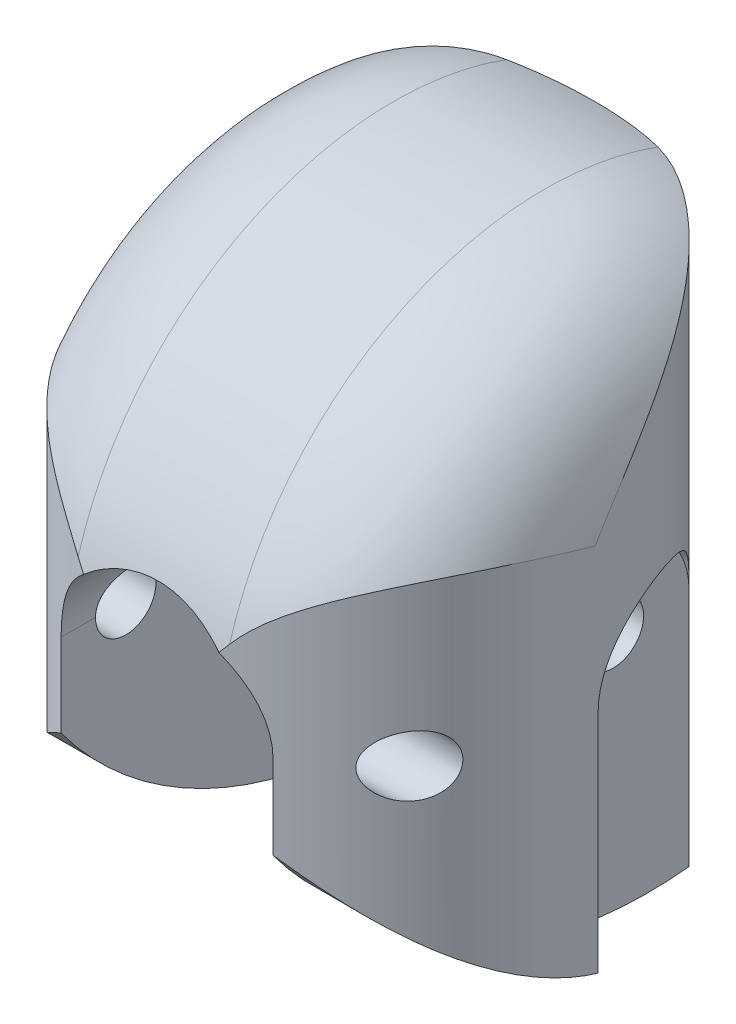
ISO-10303-21;
HEADER;
FILE_DESCRIPTION(('STEP AP214'),'2;1');
FILE_NAME('part.step','',(''),(''),'','','');
FILE_SCHEMA(('AUTOMOTIVE_DESIGN { 1 0 10303 214 1 1 1 1 }'));
ENDSEC;
DATA;
#1=APPLICATION_CONTEXT('core data for automotive mechanical design processes');
#2=APPLICATION_PROTOCOL_DEFINITION('international standard','automotive_design',2000,#1);
#3=PRODUCT_CONTEXT('',#1,'mechanical');
#4=PRODUCT('Part','Part','',(#3));
#5=PRODUCT_RELATED_PRODUCT_CATEGORY('part','',(#4));
#6=PRODUCT_DEFINITION_FORMATION('','',#4);
#7=PRODUCT_DEFINITION_CONTEXT('part definition',#1,'design');
#8=PRODUCT_DEFINITION('design','',#6,#7);
#9=PRODUCT_DEFINITION_SHAPE('','',#8);
#10=(LENGTH_UNIT() NAMED_UNIT(*) SI_UNIT(.MILLI.,.METRE.));
#11=(NAMED_UNIT(*) PLANE_ANGLE_UNIT() SI_UNIT($,.RADIAN.));
#12=(NAMED_UNIT(*) SI_UNIT($,.STERADIAN.) SOLID_ANGLE_UNIT());
#13=UNCERTAINTY_MEASURE_WITH_UNIT(LENGTH_MEASURE(1.E-05),#10,'distance_accuracy_value','');
#14=(GEOMETRIC_REPRESENTATION_CONTEXT(3) GLOBAL_UNCERTAINTY_ASSIGNED_CONTEXT((#13)) GLOBAL_UNIT_ASSIGNED_CONTEXT((#10,
#11,#12)) REPRESENTATION_CONTEXT('',''));
#15=CARTESIAN_POINT('',(0.,0.,0.));
#16=DIRECTION('',(0.,0.,1.));
#17=DIRECTION('',(1.,0.,0.));
#18=AXIS2_PLACEMENT_3D('',#15,#16,#17);
#19=CARTESIAN_POINT('',(0.,0.,0.));
#20=DIRECTION('',(0.,-1.,0.));
#21=DIRECTION('',(0.,0.,-1.));
#22=AXIS2_PLACEMENT_3D('',#19,#20,#21);
#23=CYLINDRICAL_SURFACE('',#22,7.5);
#24=CARTESIAN_POINT('',(0.,5.59999999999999,0.));
#25=DIRECTION('',(-0.866025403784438,0.5,0.));
#26=DIRECTION('',(-0.5,-0.866025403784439,0.));
#27=AXIS2_PLACEMENT_3D('',#24,#25,#26);
#28=ELLIPSE('',#27,15.,7.5);
#29=CARTESIAN_POINT('',(-3.2331615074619,0.,-6.76732344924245));
#30=VERTEX_POINT('',#29);
#31=CARTESIAN_POINT('',(-1.61658075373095,2.8,-7.32370580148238));
#32=VERTEX_POINT('',#31);
#33=EDGE_CURVE('E355',#30,#32,#28,.F.);
#34=ORIENTED_EDGE('',*,*,#33,.F.);
#35=CARTESIAN_POINT('',(0.,-5.6,0.));
#36=DIRECTION('',(-0.866025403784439,-0.5,0.));
#37=DIRECTION('',(0.5,-0.866025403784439,0.));
#38=AXIS2_PLACEMENT_3D('',#35,#36,#37);
#39=ELLIPSE('',#38,15.,7.5);
#40=CARTESIAN_POINT('',(-1.61658075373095,-2.8,-7.32370580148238));
#41=VERTEX_POINT('',#40);
#42=EDGE_CURVE('E454',#30,#41,#39,.T.);
#43=ORIENTED_EDGE('',*,*,#42,.T.);
#44=CARTESIAN_POINT('',(0.,-2.8,0.));
#45=DIRECTION('',(0.,-1.,0.));
#46=DIRECTION('',(0.,0.,-1.));
#47=AXIS2_PLACEMENT_3D('',#44,#45,#46);
#48=CIRCLE('',#47,7.5);
#49=CARTESIAN_POINT('',(1.61658075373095,-2.8,-7.32370580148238));
#50=VERTEX_POINT('',#49);
#51=EDGE_CURVE('E462',#41,#50,#48,.T.);
#52=ORIENTED_EDGE('',*,*,#51,.T.);
#53=CARTESIAN_POINT('',(0.,-5.6,0.));
#54=DIRECTION('',(0.866025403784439,-0.5,0.));
#55=DIRECTION('',(-0.5,-0.866025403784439,0.));
#56=AXIS2_PLACEMENT_3D('',#53,#54,#55);
#57=ELLIPSE('',#56,15.,7.5);
#58=CARTESIAN_POINT('',(3.2331615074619,0.,-6.76732344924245));
#59=VERTEX_POINT('',#58);
#60=EDGE_CURVE('E458',#50,#59,#57,.T.);
#61=ORIENTED_EDGE('',*,*,#60,.T.);
#62=CARTESIAN_POINT('',(0.,5.6,0.));
#63=DIRECTION('',(0.866025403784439,0.5,0.));
#64=DIRECTION('',(0.5,-0.866025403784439,0.));
#65=AXIS2_PLACEMENT_3D('',#62,#63,#64);
#66=ELLIPSE('',#65,15.,7.5);
#67=CARTESIAN_POINT('',(1.61658075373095,2.8,-7.32370580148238));
#68=VERTEX_POINT('',#67);
#69=EDGE_CURVE('E795',#68,#59,#66,.F.);
#70=ORIENTED_EDGE('',*,*,#69,.F.);
#71=CARTESIAN_POINT('',(0.,2.8,0.));
#72=DIRECTION('',(0.,1.,0.));
#73=DIRECTION('',(0.,0.,1.));
#74=AXIS2_PLACEMENT_3D('',#71,#72,#73);
#75=CIRCLE('',#74,7.5);
#76=EDGE_CURVE('E777',#32,#68,#75,.F.);
#77=ORIENTED_EDGE('',*,*,#76,.F.);
#78=EDGE_LOOP('',(#34,#43,#52,#61,#70,#77));
#79=FACE_BOUND('',#78,.T.);
#80=CARTESIAN_POINT('',(6.6332495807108,0.,3.5));
#81=CARTESIAN_POINT('',(6.63324728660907,-0.0509858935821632,3.50000609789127));
#82=CARTESIAN_POINT('',(6.6311845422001,-0.102031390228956,3.50392255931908));
#83=CARTESIAN_POINT('',(6.62296801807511,-0.202687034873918,3.51942706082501));
#84=CARTESIAN_POINT('',(6.61680489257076,-0.252293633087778,3.53103262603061));
#85=CARTESIAN_POINT('',(6.60054926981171,-0.348459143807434,3.56132586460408));
#86=CARTESIAN_POINT('',(6.59046739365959,-0.395025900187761,3.57999439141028));
#87=CARTESIAN_POINT('',(6.5666102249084,-0.484070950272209,3.62356782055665));
#88=CARTESIAN_POINT('',(6.5528363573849,-0.526550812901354,3.6484703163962));
#89=CARTESIAN_POINT('',(6.52134247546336,-0.608008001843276,3.7044779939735));
#90=CARTESIAN_POINT('',(6.50349966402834,-0.646807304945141,3.73577208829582));
#91=CARTESIAN_POINT('',(6.46455981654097,-0.718515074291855,3.80275782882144));
#92=CARTESIAN_POINT('',(6.44346152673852,-0.751421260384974,3.83845116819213));
#93=CARTESIAN_POINT('',(6.39606200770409,-0.814166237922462,3.91697630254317));
#94=CARTESIAN_POINT('',(6.36944711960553,-0.84332069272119,3.9601641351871));
#95=CARTESIAN_POINT('',(6.31332316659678,-0.894011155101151,4.04903918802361));
#96=CARTESIAN_POINT('',(6.2838126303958,-0.915543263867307,4.09472767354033));
#97=CARTESIAN_POINT('',(6.21789267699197,-0.953821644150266,4.19426684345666));
#98=CARTESIAN_POINT('',(6.18110908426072,-0.969385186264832,4.24832343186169));
#99=CARTESIAN_POINT('',(6.10523155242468,-0.991218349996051,4.35666545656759));
#100=CARTESIAN_POINT('',(6.06613653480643,-0.997483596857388,4.41095098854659));
#101=CARTESIAN_POINT('',(5.97955227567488,-1.00159976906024,4.52781335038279));
#102=CARTESIAN_POINT('',(5.93176697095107,-0.99783681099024,4.59022854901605));
#103=CARTESIAN_POINT('',(5.83507842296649,-0.979114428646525,4.71253176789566));
#104=CARTESIAN_POINT('',(5.78617386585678,-0.96414111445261,4.7724165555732));
#105=CARTESIAN_POINT('',(5.68169922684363,-0.920698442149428,4.89650236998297));
#106=CARTESIAN_POINT('',(5.62613717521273,-0.890656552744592,4.9601647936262));
#107=CARTESIAN_POINT('',(5.51714447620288,-0.816896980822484,5.08111371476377));
#108=CARTESIAN_POINT('',(5.46371185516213,-0.77319231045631,5.13840620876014));
#109=CARTESIAN_POINT('',(5.37808479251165,-0.687738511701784,5.22769068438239));
#110=CARTESIAN_POINT('',(5.34451371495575,-0.649733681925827,5.26195744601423));
#111=CARTESIAN_POINT('',(5.2812514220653,-0.566880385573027,5.3254461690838));
#112=CARTESIAN_POINT('',(5.25155346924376,-0.522044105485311,5.35467692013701));
#113=CARTESIAN_POINT('',(5.20450828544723,-0.437129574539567,5.40036133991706));
#114=CARTESIAN_POINT('',(5.18590794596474,-0.398496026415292,5.41819751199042));
#115=CARTESIAN_POINT('',(5.15330318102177,-0.317576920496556,5.44921769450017));
#116=CARTESIAN_POINT('',(5.13929263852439,-0.275296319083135,5.46240789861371));
#117=CARTESIAN_POINT('',(5.11873412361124,-0.19438055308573,5.48167229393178));
#118=CARTESIAN_POINT('',(5.11138823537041,-0.156132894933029,5.48851106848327));
#119=CARTESIAN_POINT('',(5.10152614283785,-0.0784894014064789,5.4976793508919));
#120=CARTESIAN_POINT('',(5.09900700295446,-0.0390942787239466,5.50001159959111));
#121=CARTESIAN_POINT('',(5.09903213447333,0.0397356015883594,5.49998829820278));
#122=CARTESIAN_POINT('',(5.10158200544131,0.0791703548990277,5.49762756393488));
#123=CARTESIAN_POINT('',(5.11151474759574,0.156882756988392,5.48839331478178));
#124=CARTESIAN_POINT('',(5.11889993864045,0.195159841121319,5.48151763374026));
#125=CARTESIAN_POINT('',(5.13787945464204,0.269604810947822,5.46373140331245));
#126=CARTESIAN_POINT('',(5.14946977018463,0.305774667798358,5.45282469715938));
#127=CARTESIAN_POINT('',(5.17609610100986,0.375523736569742,5.42755624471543));
#128=CARTESIAN_POINT('',(5.19113375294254,0.409101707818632,5.41319285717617));
#129=CARTESIAN_POINT('',(5.23316976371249,0.491582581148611,5.37263362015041));
#130=CARTESIAN_POINT('',(5.26213187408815,0.538453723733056,5.34433203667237));
#131=CARTESIAN_POINT('',(5.32441477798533,0.625208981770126,5.2822869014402));
#132=CARTESIAN_POINT('',(5.35774729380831,0.665073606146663,5.24852865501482));
#133=CARTESIAN_POINT('',(5.43933297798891,0.750812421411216,5.16412487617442));
#134=CARTESIAN_POINT('',(5.48871340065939,0.793876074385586,5.11171360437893));
#135=CARTESIAN_POINT('',(5.58975013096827,0.867988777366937,5.00103309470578));
#136=CARTESIAN_POINT('',(5.64140751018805,0.899032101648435,4.9427610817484));
#137=CARTESIAN_POINT('',(5.7460661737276,0.949509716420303,4.8207139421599));
#138=CARTESIAN_POINT('',(5.79907573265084,0.968750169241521,4.75686564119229));
#139=CARTESIAN_POINT('',(5.9041414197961,0.994297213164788,4.62581565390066));
#140=CARTESIAN_POINT('',(5.95619714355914,1.00059843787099,4.55861258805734));
#141=CARTESIAN_POINT('',(6.06126586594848,0.999270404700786,4.41805783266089));
#142=CARTESIAN_POINT('',(6.11412087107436,0.990708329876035,4.34459054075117));
#143=CARTESIAN_POINT('',(6.21529998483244,0.95641430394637,4.19855768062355));
#144=CARTESIAN_POINT('',(6.2636332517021,0.9307179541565,4.12599055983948));
#145=CARTESIAN_POINT('',(6.3400201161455,0.871831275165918,4.00718475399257));
#146=CARTESIAN_POINT('',(6.36975517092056,0.843336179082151,3.95968132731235));
#147=CARTESIAN_POINT('',(6.42542929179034,0.777547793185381,3.86868086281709));
#148=CARTESIAN_POINT('',(6.45137086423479,0.740260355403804,3.82518118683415));
#149=CARTESIAN_POINT('',(6.49891155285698,0.65699387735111,3.74384685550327));
#150=CARTESIAN_POINT('',(6.52048154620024,0.610960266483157,3.70605059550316));
#151=CARTESIAN_POINT('',(6.55839906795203,0.51135457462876,3.63853120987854));
#152=CARTESIAN_POINT('',(6.57474690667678,0.457782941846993,3.6088076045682));
#153=CARTESIAN_POINT('',(6.60007242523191,0.351562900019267,3.56225547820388));
#154=CARTESIAN_POINT('',(6.60969174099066,0.299550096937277,3.54431990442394));
#155=CARTESIAN_POINT('',(6.62415365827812,0.19276060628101,3.51721929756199));
#156=CARTESIAN_POINT('',(6.62901065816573,0.137992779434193,3.50802783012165));
#157=CARTESIAN_POINT('',(6.6326460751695,0.0552834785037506,3.50114345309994));
#158=CARTESIAN_POINT('',(6.63325082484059,0.0276505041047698,3.49999669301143));
#159=CARTESIAN_POINT('',(6.6332495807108,0.,3.5));
#160=B_SPLINE_CURVE_WITH_KNOTS('',3,(#80,#81,#82,#83,#84,#85,#86,#87,#88,#89,#90,#91,#92,#93,
#94,#95,#96,#97,#98,#99,#100,#101,#102,#103,#104,#105,#106,#107,#108,#109,#110,#111,#112,#113,
#114,#115,#116,#117,#118,#119,#120,#121,#122,#123,#124,#125,#126,#127,#128,#129,#130,#131,#132,
#133,#134,#135,#136,#137,#138,#139,#140,#141,#142,#143,#144,#145,#146,#147,#148,#149,#150,#151,
#152,#153,#154,#155,#156,#157,#158,#159),.UNSPECIFIED.,.T.,.F.,(4,2,2,2,2,2,2,2,2,2,2,2,2,2,2,2,
2,2,2,2,2,2,2,2,2,2,2,2,2,2,2,2,2,2,2,2,2,2,2,4),(0.,0.152872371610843,0.306094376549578,
0.458903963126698,0.611654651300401,0.769831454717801,0.928069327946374,1.10291376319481,
1.27784750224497,1.47871508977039,1.67967715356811,1.91484818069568,2.15031107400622,
2.41814796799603,2.6857305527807,2.86877709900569,3.0515008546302,3.19032668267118,
3.32896673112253,3.44707372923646,3.56510887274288,3.68327447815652,3.80149681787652,
3.91960673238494,4.03777283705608,4.22255318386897,4.40783969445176,4.65823367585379,
4.90874678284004,5.1632710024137,5.41790076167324,5.68909376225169,5.95972503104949,
6.14759008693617,6.33533045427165,6.52428314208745,6.7132245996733,6.87989330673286,
7.04605654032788,7.128961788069),.UNSPECIFIED.);
#161=CARTESIAN_POINT('',(6.6332495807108,0.,3.5));
#162=VERTEX_POINT('',#161);
#163=EDGE_CURVE('E292',#162,#162,#160,.T.);
#164=ORIENTED_EDGE('',*,*,#163,.T.);
#165=EDGE_LOOP('',(#164));
#166=FACE_BOUND('',#165,.T.);
#167=CARTESIAN_POINT('',(-6.6332495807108,0.,3.5));
#168=CARTESIAN_POINT('',(-6.63324728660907,0.0509858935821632,3.50000609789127));
#169=CARTESIAN_POINT('',(-6.6311845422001,0.102031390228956,3.50392255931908));
#170=CARTESIAN_POINT('',(-6.62296801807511,0.202687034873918,3.51942706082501));
#171=CARTESIAN_POINT('',(-6.61680489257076,0.252293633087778,3.53103262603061));
#172=CARTESIAN_POINT('',(-6.60054926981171,0.348459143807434,3.56132586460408));
#173=CARTESIAN_POINT('',(-6.59046739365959,0.395025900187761,3.57999439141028));
#174=CARTESIAN_POINT('',(-6.5666102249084,0.484070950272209,3.62356782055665));
#175=CARTESIAN_POINT('',(-6.5528363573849,0.526550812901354,3.6484703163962));
#176=CARTESIAN_POINT('',(-6.52134247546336,0.608008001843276,3.7044779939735));
#177=CARTESIAN_POINT('',(-6.50349966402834,0.646807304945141,3.73577208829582));
#178=CARTESIAN_POINT('',(-6.46455981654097,0.718515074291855,3.80275782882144));
#179=CARTESIAN_POINT('',(-6.44346152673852,0.751421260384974,3.83845116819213));
#180=CARTESIAN_POINT('',(-6.39606200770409,0.814166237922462,3.91697630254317));
#181=CARTESIAN_POINT('',(-6.36944711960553,0.84332069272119,3.9601641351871));
#182=CARTESIAN_POINT('',(-6.31332316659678,0.894011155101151,4.04903918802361));
#183=CARTESIAN_POINT('',(-6.2838126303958,0.915543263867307,4.09472767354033));
#184=CARTESIAN_POINT('',(-6.21789267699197,0.953821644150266,4.19426684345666));
#185=CARTESIAN_POINT('',(-6.18110908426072,0.969385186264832,4.24832343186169));
#186=CARTESIAN_POINT('',(-6.10523155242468,0.991218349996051,4.35666545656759));
#187=CARTESIAN_POINT('',(-6.06613653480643,0.997483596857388,4.41095098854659));
#188=CARTESIAN_POINT('',(-5.97955227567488,1.00159976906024,4.52781335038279));
#189=CARTESIAN_POINT('',(-5.93176697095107,0.99783681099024,4.59022854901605));
#190=CARTESIAN_POINT('',(-5.83507842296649,0.979114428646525,4.71253176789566));
#191=CARTESIAN_POINT('',(-5.78617386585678,0.96414111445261,4.7724165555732));
#192=CARTESIAN_POINT('',(-5.68169922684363,0.920698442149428,4.89650236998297));
#193=CARTESIAN_POINT('',(-5.62613717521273,0.890656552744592,4.9601647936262));
#194=CARTESIAN_POINT('',(-5.51714447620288,0.816896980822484,5.08111371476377));
#195=CARTESIAN_POINT('',(-5.46371185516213,0.77319231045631,5.13840620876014));
#196=CARTESIAN_POINT('',(-5.37808479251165,0.687738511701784,5.22769068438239));
#197=CARTESIAN_POINT('',(-5.34451371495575,0.649733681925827,5.26195744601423));
#198=CARTESIAN_POINT('',(-5.2812514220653,0.566880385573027,5.3254461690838));
#199=CARTESIAN_POINT('',(-5.25155346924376,0.522044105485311,5.35467692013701));
#200=CARTESIAN_POINT('',(-5.20450828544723,0.437129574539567,5.40036133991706));
#201=CARTESIAN_POINT('',(-5.18590794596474,0.398496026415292,5.41819751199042));
#202=CARTESIAN_POINT('',(-5.15330318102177,0.317576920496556,5.44921769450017));
#203=CARTESIAN_POINT('',(-5.13929263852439,0.275296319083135,5.46240789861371));
#204=CARTESIAN_POINT('',(-5.11873412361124,0.19438055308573,5.48167229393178));
#205=CARTESIAN_POINT('',(-5.11138823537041,0.156132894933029,5.48851106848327));
#206=CARTESIAN_POINT('',(-5.10152614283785,0.0784894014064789,5.4976793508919));
#207=CARTESIAN_POINT('',(-5.09900700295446,0.0390942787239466,5.50001159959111));
#208=CARTESIAN_POINT('',(-5.09903213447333,-0.0397356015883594,5.49998829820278));
#209=CARTESIAN_POINT('',(-5.10158200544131,-0.0791703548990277,5.49762756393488));
#210=CARTESIAN_POINT('',(-5.11151474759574,-0.156882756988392,5.48839331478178));
#211=CARTESIAN_POINT('',(-5.11889993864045,-0.195159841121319,5.48151763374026));
#212=CARTESIAN_POINT('',(-5.13787945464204,-0.269604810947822,5.46373140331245));
#213=CARTESIAN_POINT('',(-5.14946977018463,-0.305774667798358,5.45282469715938));
#214=CARTESIAN_POINT('',(-5.17609610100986,-0.375523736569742,5.42755624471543));
#215=CARTESIAN_POINT('',(-5.19113375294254,-0.409101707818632,5.41319285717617));
#216=CARTESIAN_POINT('',(-5.23316976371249,-0.491582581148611,5.37263362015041));
#217=CARTESIAN_POINT('',(-5.26213187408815,-0.538453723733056,5.34433203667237));
#218=CARTESIAN_POINT('',(-5.32441477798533,-0.625208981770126,5.2822869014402));
#219=CARTESIAN_POINT('',(-5.35774729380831,-0.665073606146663,5.24852865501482));
#220=CARTESIAN_POINT('',(-5.43933297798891,-0.750812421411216,5.16412487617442));
#221=CARTESIAN_POINT('',(-5.48871340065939,-0.793876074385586,5.11171360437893));
#222=CARTESIAN_POINT('',(-5.58975013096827,-0.867988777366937,5.00103309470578));
#223=CARTESIAN_POINT('',(-5.64140751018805,-0.899032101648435,4.9427610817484));
#224=CARTESIAN_POINT('',(-5.7460661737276,-0.949509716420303,4.8207139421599));
#225=CARTESIAN_POINT('',(-5.79907573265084,-0.968750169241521,4.75686564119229));
#226=CARTESIAN_POINT('',(-5.9041414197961,-0.994297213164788,4.62581565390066));
#227=CARTESIAN_POINT('',(-5.95619714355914,-1.00059843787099,4.55861258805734));
#228=CARTESIAN_POINT('',(-6.06126586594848,-0.999270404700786,4.41805783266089));
#229=CARTESIAN_POINT('',(-6.11412087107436,-0.990708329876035,4.34459054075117));
#230=CARTESIAN_POINT('',(-6.21529998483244,-0.95641430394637,4.19855768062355));
#231=CARTESIAN_POINT('',(-6.2636332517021,-0.9307179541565,4.12599055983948));
#232=CARTESIAN_POINT('',(-6.3400201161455,-0.871831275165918,4.00718475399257));
#233=CARTESIAN_POINT('',(-6.36975517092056,-0.843336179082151,3.95968132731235));
#234=CARTESIAN_POINT('',(-6.42542929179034,-0.777547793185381,3.86868086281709));
#235=CARTESIAN_POINT('',(-6.45137086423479,-0.740260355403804,3.82518118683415));
#236=CARTESIAN_POINT('',(-6.49891155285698,-0.65699387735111,3.74384685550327));
#237=CARTESIAN_POINT('',(-6.52048154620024,-0.610960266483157,3.70605059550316));
#238=CARTESIAN_POINT('',(-6.55839906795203,-0.51135457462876,3.63853120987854));
#239=CARTESIAN_POINT('',(-6.57474690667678,-0.457782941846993,3.6088076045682));
#240=CARTESIAN_POINT('',(-6.60007242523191,-0.351562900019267,3.56225547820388));
#241=CARTESIAN_POINT('',(-6.60969174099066,-0.299550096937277,3.54431990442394));
#242=CARTESIAN_POINT('',(-6.62415365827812,-0.19276060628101,3.51721929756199));
#243=CARTESIAN_POINT('',(-6.62901065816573,-0.137992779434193,3.50802783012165));
#244=CARTESIAN_POINT('',(-6.6326460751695,-0.0552834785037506,3.50114345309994));
#245=CARTESIAN_POINT('',(-6.63325082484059,-0.0276505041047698,3.49999669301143));
#246=CARTESIAN_POINT('',(-6.6332495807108,0.,3.5));
#247=B_SPLINE_CURVE_WITH_KNOTS('',3,(#167,#168,#169,#170,#171,#172,#173,#174,#175,#176,#177,
#178,#179,#180,#181,#182,#183,#184,#185,#186,#187,#188,#189,#190,#191,#192,#193,#194,#195,#196,
#197,#198,#199,#200,#201,#202,#203,#204,#205,#206,#207,#208,#209,#210,#211,#212,#213,#214,#215,
#216,#217,#218,#219,#220,#221,#222,#223,#224,#225,#226,#227,#228,#229,#230,#231,#232,#233,#234,
#235,#236,#237,#238,#239,#240,#241,#242,#243,#244,#245,#246),.UNSPECIFIED.,.T.,.F.,(4,2,2,2,2,2,
2,2,2,2,2,2,2,2,2,2,2,2,2,2,2,2,2,2,2,2,2,2,2,2,2,2,2,2,2,2,2,2,2,4),(0.,0.152872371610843,
0.306094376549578,0.458903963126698,0.611654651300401,0.769831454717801,0.928069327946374,
1.10291376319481,1.27784750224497,1.47871508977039,1.67967715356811,1.91484818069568,
2.15031107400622,2.41814796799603,2.6857305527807,2.86877709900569,3.0515008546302,
3.19032668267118,3.32896673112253,3.44707372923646,3.56510887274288,3.68327447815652,
3.80149681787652,3.91960673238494,4.03777283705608,4.22255318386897,4.40783969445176,
4.65823367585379,4.90874678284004,5.1632710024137,5.41790076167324,5.68909376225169,
5.95972503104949,6.14759008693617,6.33533045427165,6.52428314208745,6.7132245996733,
6.87989330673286,7.04605654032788,7.128961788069),.UNSPECIFIED.);
#248=CARTESIAN_POINT('',(-6.6332495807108,0.,3.5));
#249=VERTEX_POINT('',#248);
#250=EDGE_CURVE('E298',#249,#249,#247,.T.);
#251=ORIENTED_EDGE('',*,*,#250,.T.);
#252=EDGE_LOOP('',(#251));
#253=FACE_BOUND('',#252,.T.);
#254=DIRECTION('',(0.,-1.,0.));
#255=VECTOR('',#254,1.);
#256=CARTESIAN_POINT('',(-7.49933330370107,0.,-0.0999999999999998));
#257=LINE('',#256,#255);
#258=CARTESIAN_POINT('',(-7.49933330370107,-7.47215413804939,-0.100000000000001));
#259=VERTEX_POINT('',#258);
#260=CARTESIAN_POINT('',(-7.49933330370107,0.,-0.0999999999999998));
#261=VERTEX_POINT('',#260);
#262=EDGE_CURVE('E223',#259,#261,#257,.F.);
#263=ORIENTED_EDGE('',*,*,#262,.F.);
#264=CARTESIAN_POINT('',(3.5,-2.74183853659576,6.6332495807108));
#265=CARTESIAN_POINT('',(3.61868374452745,-2.82718449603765,6.57060956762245));
#266=CARTESIAN_POINT('',(3.73485276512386,-2.91399106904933,6.50525774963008));
#267=CARTESIAN_POINT('',(3.96233378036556,-3.08974715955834,6.36926434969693));
#268=CARTESIAN_POINT('',(4.07364672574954,-3.17869625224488,6.29862381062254));
#269=CARTESIAN_POINT('',(4.29165809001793,-3.35801263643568,6.15214625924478));
#270=CARTESIAN_POINT('',(4.39835550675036,-3.44838023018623,6.07630812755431));
#271=CARTESIAN_POINT('',(4.60721122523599,-3.62991319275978,5.91951480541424));
#272=CARTESIAN_POINT('',(4.70936925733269,-3.72107860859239,5.8385593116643));
#273=CARTESIAN_POINT('',(5.01059926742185,-3.99631648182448,5.58683850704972));
#274=CARTESIAN_POINT('',(5.20285651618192,-4.18082156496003,5.40827585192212));
#275=CARTESIAN_POINT('',(5.56878170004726,-4.54718940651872,5.03068052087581));
#276=CARTESIAN_POINT('',(5.74245327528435,-4.72905267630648,4.83165186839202));
#277=CARTESIAN_POINT('',(6.0382202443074,-5.05229824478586,4.45373433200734));
#278=CARTESIAN_POINT('',(6.16378686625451,-5.19469258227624,4.27842264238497));
#279=CARTESIAN_POINT('',(6.40101284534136,-5.47414759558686,3.9146114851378));
#280=CARTESIAN_POINT('',(6.5126734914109,-5.61120876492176,3.72611324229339));
#281=CARTESIAN_POINT('',(6.72045675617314,-5.87801119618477,3.33676607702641));
#282=CARTESIAN_POINT('',(6.81662365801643,-6.00777260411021,3.135954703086));
#283=CARTESIAN_POINT('',(6.992210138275,-6.25876937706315,2.72204061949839));
#284=CARTESIAN_POINT('',(7.07163296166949,-6.38000639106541,2.50894030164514));
#285=CARTESIAN_POINT('',(7.19817495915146,-6.58951163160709,2.11432815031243));
#286=CARTESIAN_POINT('',(7.24857474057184,-6.67958178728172,1.93482039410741));
#287=CARTESIAN_POINT('',(7.33641265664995,-6.85229936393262,1.56919767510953));
#288=CARTESIAN_POINT('',(7.3738534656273,-6.93494831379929,1.38308408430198));
#289=CARTESIAN_POINT('',(7.4347977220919,-7.09202349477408,1.0051893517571));
#290=CARTESIAN_POINT('',(7.45830237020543,-7.16645043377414,0.813408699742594));
#291=CARTESIAN_POINT('',(7.4904578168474,-7.30636808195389,0.425368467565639));
#292=CARTESIAN_POINT('',(7.49910838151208,-7.37185865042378,0.229108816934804));
#293=CARTESIAN_POINT('',(7.50076551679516,-7.49367353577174,-0.167591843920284));
#294=CARTESIAN_POINT('',(7.49367915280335,-7.54994128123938,-0.368050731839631));
#295=CARTESIAN_POINT('',(7.46306441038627,-7.65243548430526,-0.77029103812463));
#296=CARTESIAN_POINT('',(7.43953594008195,-7.69866188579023,-0.972072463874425));
#297=CARTESIAN_POINT('',(7.37569970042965,-7.78090843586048,-1.37500932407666));
#298=CARTESIAN_POINT('',(7.3353963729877,-7.81693128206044,-1.57616491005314));
#299=CARTESIAN_POINT('',(7.23795797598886,-7.8789125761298,-1.97592504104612));
#300=CARTESIAN_POINT('',(7.18082422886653,-7.90487181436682,-2.17452978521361));
#301=CARTESIAN_POINT('',(7.05643638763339,-7.94506183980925,-2.54784506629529));
#302=CARTESIAN_POINT('',(6.99073741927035,-7.96019723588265,-2.72297945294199));
#303=CARTESIAN_POINT('',(6.84620611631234,-7.98314030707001,-3.06830655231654));
#304=CARTESIAN_POINT('',(6.76736936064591,-7.990945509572,-3.23849757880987));
#305=CARTESIAN_POINT('',(6.59711638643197,-7.9998689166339,-3.57256112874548));
#306=CARTESIAN_POINT('',(6.50570468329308,-8.00098951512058,-3.73643589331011));
#307=CARTESIAN_POINT('',(6.3108555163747,-7.99732815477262,-4.05688077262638));
#308=CARTESIAN_POINT('',(6.20741335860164,-7.99254388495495,-4.21344800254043));
#309=CARTESIAN_POINT('',(5.98746325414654,-7.97782435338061,-4.52068008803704));
#310=CARTESIAN_POINT('',(5.87077220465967,-7.96780762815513,-4.67120982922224));
#311=CARTESIAN_POINT('',(5.62642039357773,-7.94355482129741,-4.96282164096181));
#312=CARTESIAN_POINT('',(5.49875492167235,-7.92931692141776,-5.10389960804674));
#313=CARTESIAN_POINT('',(5.23326367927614,-7.89764367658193,-5.37578439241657));
#314=CARTESIAN_POINT('',(5.09543674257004,-7.88020796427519,-5.50659002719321));
#315=CARTESIAN_POINT('',(4.81042297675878,-7.84317642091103,-5.75724338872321));
#316=CARTESIAN_POINT('',(4.66323560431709,-7.82358046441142,-5.87709047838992));
#317=CARTESIAN_POINT('',(4.34755757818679,-7.78156382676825,-6.11481761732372));
#318=CARTESIAN_POINT('',(4.17831628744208,-7.75904417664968,-6.23168496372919));
#319=CARTESIAN_POINT('',(3.83087330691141,-7.71396851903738,-6.45109399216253));
#320=CARTESIAN_POINT('',(3.65267440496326,-7.69141252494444,-6.55364009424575));
#321=CARTESIAN_POINT('',(3.28824964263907,-7.64746583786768,-6.74386242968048));
#322=CARTESIAN_POINT('',(3.10201973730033,-7.62607574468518,-6.83153105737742));
#323=CARTESIAN_POINT('',(2.72284090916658,-7.58561187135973,-6.99131229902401));
#324=CARTESIAN_POINT('',(2.52989459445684,-7.56653720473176,-7.06343087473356));
#325=CARTESIAN_POINT('',(2.13276368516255,-7.53119046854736,-7.19348510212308));
#326=CARTESIAN_POINT('',(1.92841544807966,-7.51501573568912,-7.25094870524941));
#327=CARTESIAN_POINT('',(1.51528789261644,-7.48707283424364,-7.34839742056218));
#328=CARTESIAN_POINT('',(1.30650848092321,-7.47530475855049,-7.38838216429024));
#329=CARTESIAN_POINT('',(0.886152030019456,-7.45684160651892,-7.45049380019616));
#330=CARTESIAN_POINT('',(0.674575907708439,-7.45014490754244,-7.47262640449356));
#331=CARTESIAN_POINT('',(0.250210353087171,-7.44219967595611,-7.49883880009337));
#332=CARTESIAN_POINT('',(0.0374209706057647,-7.4409509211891,-7.50291932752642));
#333=CARTESIAN_POINT('',(-0.379156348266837,-7.44391014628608,-7.49318981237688));
#334=CARTESIAN_POINT('',(-0.582962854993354,-7.44790117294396,-7.48009109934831));
#335=CARTESIAN_POINT('',(-0.988672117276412,-7.46075547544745,-7.43734713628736));
#336=CARTESIAN_POINT('',(-1.19057491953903,-7.4696186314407,-7.40770229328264));
#337=CARTESIAN_POINT('',(-1.59108225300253,-7.49175640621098,-7.33212075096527));
#338=CARTESIAN_POINT('',(-1.78968636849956,-7.5050315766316,-7.28618201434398));
#339=CARTESIAN_POINT('',(-2.18223487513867,-7.53530701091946,-7.17838993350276));
#340=CARTESIAN_POINT('',(-2.37617918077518,-7.55230734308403,-7.11653629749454));
#341=CARTESIAN_POINT('',(-2.75852870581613,-7.58919680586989,-6.97724868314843));
#342=CARTESIAN_POINT('',(-2.94692250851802,-7.60909145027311,-6.89978485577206));
#343=CARTESIAN_POINT('',(-3.31668250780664,-7.65072892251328,-6.72986122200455));
#344=CARTESIAN_POINT('',(-3.49804629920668,-7.67247237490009,-6.637396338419));
#345=CARTESIAN_POINT('',(-3.85262395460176,-7.71667244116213,-6.43806337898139));
#346=CARTESIAN_POINT('',(-4.02583652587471,-7.73912916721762,-6.33119302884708));
#347=CARTESIAN_POINT('',(-4.36305065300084,-7.78354308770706,-6.10370029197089));
#348=CARTESIAN_POINT('',(-4.52705214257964,-7.80550027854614,-5.98307780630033));
#349=CARTESIAN_POINT('',(-4.85134401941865,-7.8485197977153,-5.72357646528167));
#350=CARTESIAN_POINT('',(-5.01120907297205,-7.86950892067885,-5.58415309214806));
#351=CARTESIAN_POINT('',(-5.31871015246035,-7.90813265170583,-5.29209482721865));
#352=CARTESIAN_POINT('',(-5.46635079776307,-7.9257685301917,-5.13946497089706));
#353=CARTESIAN_POINT('',(-5.7483706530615,-7.95625939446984,-4.82196177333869));
#354=CARTESIAN_POINT('',(-5.88275039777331,-7.96911457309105,-4.65708892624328));
#355=CARTESIAN_POINT('',(-6.13717535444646,-7.9886530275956,-4.31628195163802));
#356=CARTESIAN_POINT('',(-6.25722136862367,-7.99533664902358,-4.14034844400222));
#357=CARTESIAN_POINT('',(-6.47806831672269,-8.00113293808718,-3.78508221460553));
#358=CARTESIAN_POINT('',(-6.57939232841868,-8.00050015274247,-3.60607902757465));
#359=CARTESIAN_POINT('',(-6.7669260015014,-7.9912388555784,-3.24051041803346));
#360=CARTESIAN_POINT('',(-6.85313597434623,-7.98261050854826,-3.05394515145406));
#361=CARTESIAN_POINT('',(-7.00973195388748,-7.95650983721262,-2.67500700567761));
#362=CARTESIAN_POINT('',(-7.08012713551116,-7.9390426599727,-2.48263756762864));
#363=CARTESIAN_POINT('',(-7.20470095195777,-7.89463933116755,-2.09378969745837));
#364=CARTESIAN_POINT('',(-7.25888072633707,-7.86770384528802,-1.89731155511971));
#365=CARTESIAN_POINT('',(-7.34704624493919,-7.80662782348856,-1.51841300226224));
#366=CARTESIAN_POINT('',(-7.38232737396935,-7.7732631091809,-1.33616707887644));
#367=CARTESIAN_POINT('',(-7.43913523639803,-7.6981816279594,-0.971265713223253));
#368=CARTESIAN_POINT('',(-7.46066287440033,-7.65646541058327,-0.788610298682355));
#369=CARTESIAN_POINT('',(-7.49021906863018,-7.56479126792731,-0.424290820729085));
#370=CARTESIAN_POINT('',(-7.49824778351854,-7.51483343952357,-0.242626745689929));
#371=CARTESIAN_POINT('',(-7.50123800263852,-7.40695346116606,0.118424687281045));
#372=CARTESIAN_POINT('',(-7.4961990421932,-7.34903102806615,0.297811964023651));
#373=CARTESIAN_POINT('',(-7.47356651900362,-7.22531675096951,0.654091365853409));
#374=CARTESIAN_POINT('',(-7.45590720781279,-7.15948520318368,0.83096545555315));
#375=CARTESIAN_POINT('',(-7.40864737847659,-7.0207295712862,1.18025729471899));
#376=CARTESIAN_POINT('',(-7.37904718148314,-6.94780567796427,1.3526751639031));
#377=CARTESIAN_POINT('',(-7.30864183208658,-6.79545025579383,1.69228648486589));
#378=CARTESIAN_POINT('',(-7.26783498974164,-6.71601774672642,1.85947914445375));
#379=CARTESIAN_POINT('',(-7.1757742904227,-6.55128618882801,2.18800784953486));
#380=CARTESIAN_POINT('',(-7.12451840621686,-6.46598600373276,2.34934275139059));
#381=CARTESIAN_POINT('',(-6.9900789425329,-6.25535982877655,2.72830939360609));
#382=CARTESIAN_POINT('',(-6.90228847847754,-6.12755604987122,2.94294518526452));
#383=CARTESIAN_POINT('',(-6.70966515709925,-5.86356509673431,3.35901627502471));
#384=CARTESIAN_POINT('',(-6.6048270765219,-5.72737536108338,3.56044750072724));
#385=CARTESIAN_POINT('',(-6.37940495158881,-5.44796049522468,3.95019289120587));
#386=CARTESIAN_POINT('',(-6.25877487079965,-5.30471559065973,4.13846613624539));
#387=CARTESIAN_POINT('',(-6.0033339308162,-5.01329894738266,4.50101809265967));
#388=CARTESIAN_POINT('',(-5.86852282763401,-4.86512712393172,4.67529656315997));
#389=CARTESIAN_POINT('',(-5.57164564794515,-4.55072759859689,5.02640539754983));
#390=CARTESIAN_POINT('',(-5.40820247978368,-4.38416744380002,5.20177224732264));
#391=CARTESIAN_POINT('',(-5.06608299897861,-4.04963767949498,5.53551529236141));
#392=CARTESIAN_POINT('',(-4.88740649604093,-3.88166805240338,5.69389127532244));
#393=CARTESIAN_POINT('',(-4.60877204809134,-3.6314664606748,5.91804683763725));
#394=CARTESIAN_POINT('',(-4.51447592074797,-3.54864788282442,5.99029850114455));
#395=CARTESIAN_POINT('',(-4.32210150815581,-3.38380099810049,6.1305471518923));
#396=CARTESIAN_POINT('',(-4.22402341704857,-3.30177265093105,6.19854435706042));
#397=CARTESIAN_POINT('',(-4.02399004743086,-3.1389719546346,6.33023347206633));
#398=CARTESIAN_POINT('',(-3.92203447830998,-3.05819970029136,6.39392505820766));
#399=CARTESIAN_POINT('',(-3.71408264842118,-2.89849131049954,6.51691206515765));
#400=CARTESIAN_POINT('',(-3.60808571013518,-2.81955548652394,6.57620674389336));
#401=CARTESIAN_POINT('',(-3.49999999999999,-2.74183853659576,6.6332495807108));
#402=B_SPLINE_CURVE_WITH_KNOTS('',3,(#264,#265,#266,#267,#268,#269,#270,#271,#272,#273,#274,
#275,#276,#277,#278,#279,#280,#281,#282,#283,#284,#285,#286,#287,#288,#289,#290,#291,#292,#293,
#294,#295,#296,#297,#298,#299,#300,#301,#302,#303,#304,#305,#306,#307,#308,#309,#310,#311,#312,
#313,#314,#315,#316,#317,#318,#319,#320,#321,#322,#323,#324,#325,#326,#327,#328,#329,#330,#331,
#332,#333,#334,#335,#336,#337,#338,#339,#340,#341,#342,#343,#344,#345,#346,#347,#348,#349,#350,
#351,#352,#353,#354,#355,#356,#357,#358,#359,#360,#361,#362,#363,#364,#365,#366,#367,#368,#369,
#370,#371,#372,#373,#374,#375,#376,#377,#378,#379,#380,#381,#382,#383,#384,#385,#386,#387,#388,
#389,#390,#391,#392,#393,#394,#395,#396,#397,#398,#399,#400,#401),.UNSPECIFIED.,.F.,.F.,(4,2,2,
2,2,2,2,2,2,2,2,2,2,2,2,2,2,2,2,2,2,2,2,2,2,2,2,2,2,2,2,2,2,2,2,2,2,2,2,2,2,2,2,2,2,2,2,2,2,2,2,
2,2,2,2,2,2,2,2,2,2,2,2,2,2,2,2,2,4),(0.,0.47703206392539,0.953970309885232,1.43101159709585,
1.90808118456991,2.86910256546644,3.82993537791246,4.60447326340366,5.37893930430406,
6.15115097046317,6.92321284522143,7.54381754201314,8.16429408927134,8.78471717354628,
9.40515002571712,10.0292565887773,10.6533666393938,11.2773115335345,11.9012074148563,
12.463534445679,13.0260510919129,13.5883662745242,14.1509015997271,14.7224681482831,
15.2942812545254,15.8661600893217,16.4380721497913,17.0580721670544,17.6778804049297,
18.2980045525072,18.9178905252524,19.5557562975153,20.1936355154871,20.8313105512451,
21.4689595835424,22.0810214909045,22.6930683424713,23.3051917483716,23.9173263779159,
24.5306428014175,25.1441672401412,25.75778865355,26.3714144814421,27.0101091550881,
27.6485613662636,28.286987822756,28.9253785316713,29.5416276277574,30.1578640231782,
30.7737419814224,31.3895766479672,31.9547067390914,32.5197996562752,33.0848859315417,
33.6499923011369,34.218064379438,34.7861211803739,35.3542636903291,35.9225165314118,
36.7157148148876,37.5091565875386,38.3049651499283,39.1007874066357,39.9755962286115,
40.8504159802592,41.2847645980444,41.7190909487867,42.1534499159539,42.5878820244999),.UNSPECIFIED.);
#403=CARTESIAN_POINT('',(-3.5,-2.74183853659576,6.6332495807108));
#404=VERTEX_POINT('',#403);
#405=EDGE_CURVE('E344',#259,#404,#402,.T.);
#406=ORIENTED_EDGE('',*,*,#405,.T.);
#407=DIRECTION('',(0.,-1.,0.));
#408=VECTOR('',#407,1.);
#409=CARTESIAN_POINT('',(-3.5,0.,6.6332495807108));
#410=LINE('',#409,#408);
#411=CARTESIAN_POINT('',(-3.5,0.,6.6332495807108));
#412=VERTEX_POINT('',#411);
#413=EDGE_CURVE('E382',#404,#412,#410,.F.);
#414=ORIENTED_EDGE('',*,*,#413,.T.);
#415=CARTESIAN_POINT('',(-0.869963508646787,3.39015685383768,7.44937336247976));
#416=CARTESIAN_POINT('',(-0.965257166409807,3.36571431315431,7.43825871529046));
#417=CARTESIAN_POINT('',(-1.05929995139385,3.33728863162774,7.42540896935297));
#418=CARTESIAN_POINT('',(-1.24420850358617,3.27284365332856,7.39666405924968));
#419=CARTESIAN_POINT('',(-1.33507605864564,3.23682871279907,7.38077064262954));
#420=CARTESIAN_POINT('',(-1.5127620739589,3.15768597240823,7.34640892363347));
#421=CARTESIAN_POINT('',(-1.59959343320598,3.11458316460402,7.32794970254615));
#422=CARTESIAN_POINT('',(-1.76901509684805,3.0215782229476,7.28890620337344));
#423=CARTESIAN_POINT('',(-1.85160484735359,2.97167520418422,7.26832164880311));
#424=CARTESIAN_POINT('',(-2.09197986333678,2.81254924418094,7.20423476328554));
#425=CARTESIAN_POINT('',(-2.24288600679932,2.69367805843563,7.15829485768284));
#426=CARTESIAN_POINT('',(-2.52309127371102,2.4332567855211,7.06441447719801));
#427=CARTESIAN_POINT('',(-2.65235988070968,2.29167521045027,7.01647129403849));
#428=CARTESIAN_POINT('',(-2.89291514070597,1.98032918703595,6.92088753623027));
#429=CARTESIAN_POINT('',(-3.00284743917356,1.80945314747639,6.87340420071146));
#430=CARTESIAN_POINT('',(-3.14473231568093,1.5398048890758,6.80906454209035));
#431=CARTESIAN_POINT('',(-3.18818297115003,1.44772667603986,6.78877013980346));
#432=CARTESIAN_POINT('',(-3.26706458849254,1.25962977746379,6.75116261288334));
#433=CARTESIAN_POINT('',(-3.30250017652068,1.16361340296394,6.73384776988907));
#434=CARTESIAN_POINT('',(-3.36095472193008,0.980807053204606,6.70484220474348));
#435=CARTESIAN_POINT('',(-3.38498186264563,0.894406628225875,6.69271548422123));
#436=CARTESIAN_POINT('',(-3.42639053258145,0.719658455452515,6.67161039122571));
#437=CARTESIAN_POINT('',(-3.44377333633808,0.63131108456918,6.66263141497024));
#438=CARTESIAN_POINT('',(-3.47175927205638,0.452851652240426,6.64809391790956));
#439=CARTESIAN_POINT('',(-3.48233111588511,0.362733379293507,6.6425511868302));
#440=CARTESIAN_POINT('',(-3.49646110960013,0.181747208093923,6.63511649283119));
#441=CARTESIAN_POINT('',(-3.50001512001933,0.0908788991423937,6.63322668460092));
#442=CARTESIAN_POINT('',(-3.5,0.,6.6332495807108));
#443=B_SPLINE_CURVE_WITH_KNOTS('',3,(#415,#416,#417,#418,#419,#420,#421,#422,#423,#424,#425,
#426,#427,#428,#429,#430,#431,#432,#433,#434,#435,#436,#437,#438,#439,#440,#441,#442),
.UNSPECIFIED.,.F.,.F.,(4,2,2,2,2,2,2,2,2,2,2,2,2,4),(0.,0.296871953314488,0.593573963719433,
0.889251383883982,1.18496731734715,1.77469736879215,2.3652522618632,2.98781500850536,
3.29892687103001,3.60985870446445,3.88104403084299,4.15217731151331,4.42454740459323,
4.69707810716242),.UNSPECIFIED.);
#444=CARTESIAN_POINT('',(-2.2338967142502,2.69438406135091,7.15958835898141));
#445=VERTEX_POINT('',#444);
#446=EDGE_CURVE('E819',#445,#412,#443,.T.);
#447=ORIENTED_EDGE('',*,*,#446,.F.);
#448=CARTESIAN_POINT('',(-2.50000000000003,3.01820276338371,7.07106781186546));
#449=CARTESIAN_POINT('',(-2.40751678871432,2.90550264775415,7.10374274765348));
#450=CARTESIAN_POINT('',(-2.31471540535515,2.79258114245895,7.13452508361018));
#451=CARTESIAN_POINT('',(-2.12847629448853,2.56629535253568,7.19230455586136));
#452=CARTESIAN_POINT('',(-2.03503856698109,2.45293106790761,7.21930169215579));
#453=CARTESIAN_POINT('',(-1.94128266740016,2.3393453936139,7.24440622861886));
#454=B_SPLINE_CURVE_WITH_KNOTS('',3,(#448,#449,#450,#451,#452,#453),.UNSPECIFIED.,.F.,.F.,(4,2,
4),(0.,0.448105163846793,0.896210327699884),.UNSPECIFIED.);
#455=CARTESIAN_POINT('',(-2.49999999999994,3.0182027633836,7.0710678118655));
#456=VERTEX_POINT('',#455);
#457=EDGE_CURVE('E811',#456,#445,#454,.T.);
#458=ORIENTED_EDGE('',*,*,#457,.F.);
#459=CARTESIAN_POINT('',(-1.78424540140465,1.87241937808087,7.28467352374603));
#460=CARTESIAN_POINT('',(-1.84185004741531,2.00050530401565,7.27055805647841));
#461=CARTESIAN_POINT('',(-1.90505903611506,2.12579864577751,7.25435906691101));
#462=CARTESIAN_POINT('',(-2.04140457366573,2.37000475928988,7.21717937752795));
#463=CARTESIAN_POINT('',(-2.11453400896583,2.48892201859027,7.19620209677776));
#464=CARTESIAN_POINT('',(-2.26911553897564,2.7191554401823,7.14895795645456));
#465=CARTESIAN_POINT('',(-2.35052161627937,2.83050844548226,7.12271963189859));
#466=CARTESIAN_POINT('',(-2.52062747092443,3.04585776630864,7.06431341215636));
#467=CARTESIAN_POINT('',(-2.60932822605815,3.14985309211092,7.03214472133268));
#468=CARTESIAN_POINT('',(-2.79241543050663,3.34996036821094,6.96146687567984));
#469=CARTESIAN_POINT('',(-2.88678906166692,3.44608901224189,6.92297169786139));
#470=CARTESIAN_POINT('',(-3.08004345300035,3.63061965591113,6.8391832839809));
#471=CARTESIAN_POINT('',(-3.1789261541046,3.71901827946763,6.79388710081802));
#472=CARTESIAN_POINT('',(-3.37988995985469,3.88810098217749,6.69618077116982));
#473=CARTESIAN_POINT('',(-3.48197384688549,3.96877808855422,6.64376429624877));
#474=CARTESIAN_POINT('',(-3.68791575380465,4.12237395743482,6.53169330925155));
#475=CARTESIAN_POINT('',(-3.79177317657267,4.19529527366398,6.47204119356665));
#476=CARTESIAN_POINT('',(-4.00792407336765,4.3387573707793,6.34064027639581));
#477=CARTESIAN_POINT('',(-4.12026358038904,4.40870483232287,6.2683186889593));
#478=CARTESIAN_POINT('',(-4.3442037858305,4.54003799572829,6.11525075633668));
#479=CARTESIAN_POINT('',(-4.45580445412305,4.60142335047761,6.03450406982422));
#480=CARTESIAN_POINT('',(-4.67699594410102,4.71589249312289,5.86473779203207));
#481=CARTESIAN_POINT('',(-4.78658630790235,4.76897440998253,5.77571634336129));
#482=CARTESIAN_POINT('',(-5.00255928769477,4.86708430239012,5.5896973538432));
#483=CARTESIAN_POINT('',(-5.10894173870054,4.91211186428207,5.49269940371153));
#484=CARTESIAN_POINT('',(-5.3246078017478,4.99720625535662,5.28418060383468));
#485=CARTESIAN_POINT('',(-5.43358842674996,5.03671957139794,5.17211981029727));
#486=CARTESIAN_POINT('',(-5.64553423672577,5.10717251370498,4.93990476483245));
#487=CARTESIAN_POINT('',(-5.74849915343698,5.13811175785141,4.81975015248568));
#488=CARTESIAN_POINT('',(-5.94741482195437,5.19172931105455,4.57203329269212));
#489=CARTESIAN_POINT('',(-6.04336591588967,5.2144080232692,4.44447140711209));
#490=CARTESIAN_POINT('',(-6.22741568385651,5.25181171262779,4.18269028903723));
#491=CARTESIAN_POINT('',(-6.3155141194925,5.26653644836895,4.04847085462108));
#492=CARTESIAN_POINT('',(-6.48608995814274,5.2887060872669,3.76939103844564));
#493=CARTESIAN_POINT('',(-6.56826258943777,5.29587807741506,3.62432263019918));
#494=CARTESIAN_POINT('',(-6.7228168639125,5.30232539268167,3.32889295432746));
#495=CARTESIAN_POINT('',(-6.79519822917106,5.3016004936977,3.17853153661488));
#496=CARTESIAN_POINT('',(-6.92973589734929,5.2925465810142,2.8734254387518));
#497=CARTESIAN_POINT('',(-6.99188633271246,5.28421322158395,2.7186783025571));
#498=CARTESIAN_POINT('',(-7.10561009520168,5.26021086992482,2.40583089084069));
#499=CARTESIAN_POINT('',(-7.15717869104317,5.24453860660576,2.24772915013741));
#500=CARTESIAN_POINT('',(-7.25284860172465,5.20473158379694,1.91775474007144));
#501=CARTESIAN_POINT('',(-7.29614269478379,5.18006783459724,1.74571152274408));
#502=CARTESIAN_POINT('',(-7.37023097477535,5.12291387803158,1.40031508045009));
#503=CARTESIAN_POINT('',(-7.40102971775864,5.09042653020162,1.2269623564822));
#504=CARTESIAN_POINT('',(-7.45019801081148,5.01795620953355,0.880413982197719));
#505=CARTESIAN_POINT('',(-7.4685900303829,4.97798695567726,0.707218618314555));
#506=CARTESIAN_POINT('',(-7.49326190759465,4.89075755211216,0.361886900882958));
#507=CARTESIAN_POINT('',(-7.49954928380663,4.8435019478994,0.189749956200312));
#508=CARTESIAN_POINT('',(-7.4999922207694,4.79085826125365,0.0124834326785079));
#509=CARTESIAN_POINT('',(-7.50000001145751,4.78899925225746,0.00624095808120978));
#510=CARTESIAN_POINT('',(-7.5,4.78713553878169,0.));
#511=B_SPLINE_CURVE_WITH_KNOTS('',3,(#459,#460,#461,#462,#463,#464,#465,#466,#467,#468,#469,
#470,#471,#472,#473,#474,#475,#476,#477,#478,#479,#480,#481,#482,#483,#484,#485,#486,#487,#488,
#489,#490,#491,#492,#493,#494,#495,#496,#497,#498,#499,#500,#501,#502,#503,#504,#505,#506,#507,
#508,#509,#510),.UNSPECIFIED.,.F.,.F.,(4,2,2,2,2,2,2,2,2,2,2,2,2,2,2,2,2,2,2,2,2,2,2,2,2,4),(0.,
0.423245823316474,0.846189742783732,1.26689888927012,1.68766452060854,2.1075127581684,
2.5275434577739,2.94794994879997,3.36821758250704,3.82015006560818,4.27210086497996,
4.72415335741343,5.17622905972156,5.65937025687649,6.14253298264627,6.62567212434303,
7.10882592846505,7.60889482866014,8.10897792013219,8.60934682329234,9.10993896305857,
9.64664918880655,10.1831635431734,10.7187036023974,11.2539109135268,11.2734511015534),.UNSPECIFIED.);
#512=CARTESIAN_POINT('',(-7.5,4.78713553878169,0.));
#513=VERTEX_POINT('',#512);
#514=EDGE_CURVE('E798',#456,#513,#511,.T.);
#515=ORIENTED_EDGE('',*,*,#514,.T.);
#516=CARTESIAN_POINT('',(-7.5,4.78713553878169,0.));
#517=CARTESIAN_POINT('',(-7.50000000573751,4.79274209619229,-0.00331503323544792));
#518=CARTESIAN_POINT('',(-7.49999780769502,4.79834589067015,-0.00663494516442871));
#519=CARTESIAN_POINT('',(-7.49965923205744,5.22731459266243,-0.26127129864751));
#520=CARTESIAN_POINT('',(-7.48662559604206,5.63486359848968,-0.540372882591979));
#521=CARTESIAN_POINT('',(-7.41872276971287,6.41421631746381,-1.14206287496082));
#522=CARTESIAN_POINT('',(-7.3637634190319,6.78594104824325,-1.46474376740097));
#523=CARTESIAN_POINT('',(-7.24147689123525,7.29992890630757,-1.9588865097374));
#524=CARTESIAN_POINT('',(-7.19645210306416,7.45866370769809,-2.11901420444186));
#525=CARTESIAN_POINT('',(-7.09265214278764,7.76640996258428,-2.44404396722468));
#526=CARTESIAN_POINT('',(-7.03388233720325,7.91542518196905,-2.60894414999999));
#527=CARTESIAN_POINT('',(-6.90135832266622,8.20280052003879,-2.94164750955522));
#528=CARTESIAN_POINT('',(-6.82762107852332,8.34117245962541,-3.10944720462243));
#529=CARTESIAN_POINT('',(-6.66398332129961,8.60648033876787,-3.44620766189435));
#530=CARTESIAN_POINT('',(-6.57408661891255,8.733418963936,-3.61516814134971));
#531=CARTESIAN_POINT('',(-6.39738370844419,8.95002513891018,-3.91759687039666));
#532=CARTESIAN_POINT('',(-6.3137136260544,9.04200225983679,-4.05124869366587));
#533=CARTESIAN_POINT('',(-6.1352557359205,9.21737104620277,-4.31673564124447));
#534=CARTESIAN_POINT('',(-6.04047030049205,9.30076453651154,-4.44857114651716));
#535=CARTESIAN_POINT('',(-5.83956630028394,9.45829463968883,-4.709197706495));
#536=CARTESIAN_POINT('',(-5.73344468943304,9.53242875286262,-4.83798793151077));
#537=CARTESIAN_POINT('',(-5.50996325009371,9.67061075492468,-5.09104917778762));
#538=CARTESIAN_POINT('',(-5.39260924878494,9.73466382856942,-5.21532249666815));
#539=CARTESIAN_POINT('',(-5.1456913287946,9.85247885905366,-5.459143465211));
#540=CARTESIAN_POINT('',(-5.01602116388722,9.90613629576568,-5.57863440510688));
#541=CARTESIAN_POINT('',(-4.74598240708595,10.0015278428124,-5.81010065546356));
#542=CARTESIAN_POINT('',(-4.6056134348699,10.0432615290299,-5.92207569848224));
#543=CARTESIAN_POINT('',(-4.31526848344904,10.113897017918,-6.13685733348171));
#544=CARTESIAN_POINT('',(-4.16530611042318,10.142816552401,-6.2396764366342));
#545=CARTESIAN_POINT('',(-3.85684879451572,10.1870930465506,-6.43490563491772));
#546=CARTESIAN_POINT('',(-3.69835553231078,10.2024526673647,-6.52731776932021));
#547=CARTESIAN_POINT('',(-3.39760429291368,10.2177198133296,-6.68812920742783));
#548=CARTESIAN_POINT('',(-3.25626412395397,10.2195223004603,-6.75807274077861));
#549=CARTESIAN_POINT('',(-2.96970007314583,10.212265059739,-6.88880858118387));
#550=CARTESIAN_POINT('',(-2.82447693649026,10.2032074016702,-6.94960262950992));
#551=CARTESIAN_POINT('',(-2.53063660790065,10.1738450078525,-7.06191974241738));
#552=CARTESIAN_POINT('',(-2.38200474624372,10.1534761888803,-7.11338774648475));
#553=CARTESIAN_POINT('',(-2.08358979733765,10.1012521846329,-7.20647487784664));
#554=CARTESIAN_POINT('',(-1.93380612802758,10.0693907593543,-7.2480886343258));
#555=CARTESIAN_POINT('',(-1.78424540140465,10.0316964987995,-7.28467352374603));
#556=B_SPLINE_CURVE_WITH_KNOTS('',3,(#516,#517,#518,#519,#520,#521,#522,#523,#524,#525,#526,
#527,#528,#529,#530,#531,#532,#533,#534,#535,#536,#537,#538,#539,#540,#541,#542,#543,#544,#545,
#546,#547,#548,#549,#550,#551,#552,#553,#554,#555),.UNSPECIFIED.,.F.,.F.,(4,2,2,2,2,2,2,2,2,2,2,
2,2,2,2,2,2,2,2,4),(0.,0.0195401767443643,1.49653376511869,2.97671258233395,3.66593491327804,
4.3548885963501,5.04306570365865,5.73108073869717,6.27822052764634,6.82524375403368,
7.37241433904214,7.91930258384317,8.47143251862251,9.0235820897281,9.5749652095,
10.1262400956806,10.5987125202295,11.0710949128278,11.546181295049,12.0215260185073),.UNSPECIFIED.);
#557=CARTESIAN_POINT('',(-2.5,10.1681095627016,-7.07106781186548));
#558=VERTEX_POINT('',#557);
#559=EDGE_CURVE('E769',#513,#558,#556,.T.);
#560=ORIENTED_EDGE('',*,*,#559,.T.);
#561=CARTESIAN_POINT('',(2.5,10.1681095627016,-7.07106781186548));
#562=CARTESIAN_POINT('',(2.31453918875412,10.1439676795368,-7.13665961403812));
#563=CARTESIAN_POINT('',(2.12622764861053,10.1218273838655,-7.19500771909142));
#564=CARTESIAN_POINT('',(1.74506787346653,10.0824122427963,-7.29682001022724));
#565=CARTESIAN_POINT('',(1.55221828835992,10.0651388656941,-7.34027970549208));
#566=CARTESIAN_POINT('',(1.16317972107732,10.0363294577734,-7.41189347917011));
#567=CARTESIAN_POINT('',(0.96698938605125,10.0247958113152,-7.44004119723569));
#568=CARTESIAN_POINT('',(0.5727592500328,10.0080356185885,-7.48072199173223));
#569=CARTESIAN_POINT('',(0.374719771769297,10.0028079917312,-7.49325774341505));
#570=CARTESIAN_POINT('',(-0.022201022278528,9.99891770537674,-7.50259937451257));
#571=CARTESIAN_POINT('',(-0.221083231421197,10.0002684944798,-7.49937303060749));
#572=CARTESIAN_POINT('',(-0.617813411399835,10.0094972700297,-7.4771503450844));
#573=CARTESIAN_POINT('',(-0.815661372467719,10.0173753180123,-7.45815385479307));
#574=CARTESIAN_POINT('',(-1.20843953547,10.0392379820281,-7.40465259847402));
#575=CARTESIAN_POINT('',(-1.40337526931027,10.0532089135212,-7.37018258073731));
#576=CARTESIAN_POINT('',(-1.78938561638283,10.0865693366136,-7.28608836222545));
#577=CARTESIAN_POINT('',(-1.98046238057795,10.1059557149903,-7.23647286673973));
#578=CARTESIAN_POINT('',(-2.22463961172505,10.133969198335,-7.16270638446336));
#579=CARTESIAN_POINT('',(-2.2800649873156,10.1405487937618,-7.14525576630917));
#580=CARTESIAN_POINT('',(-2.39040600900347,10.1540661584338,-7.1091014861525));
#581=CARTESIAN_POINT('',(-2.44532206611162,10.1610036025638,-7.09039895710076));
#582=CARTESIAN_POINT('',(-2.50000000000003,10.1681095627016,-7.07106781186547));
#583=B_SPLINE_CURVE_WITH_KNOTS('',3,(#561,#562,#563,#564,#565,#566,#567,#568,#569,#570,#571,
#572,#573,#574,#575,#576,#577,#578,#579,#580,#581,#582),.UNSPECIFIED.,.F.,.F.,(4,2,2,2,2,2,2,2,
2,2,4),(0.,0.594460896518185,1.18910094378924,1.78398780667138,2.37877271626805,
2.97477408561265,3.57078107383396,4.16545627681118,4.75979031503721,4.93521631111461,
5.11048564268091),.UNSPECIFIED.);
#584=CARTESIAN_POINT('',(2.5,10.1681095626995,-7.07106781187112));
#585=VERTEX_POINT('',#584);
#586=EDGE_CURVE('E763',#585,#558,#583,.T.);
#587=ORIENTED_EDGE('',*,*,#586,.F.);
#588=CARTESIAN_POINT('',(1.78424540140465,10.0316964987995,-7.28467352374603));
#589=CARTESIAN_POINT('',(1.91927456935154,10.0657249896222,-7.2516322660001));
#590=CARTESIAN_POINT('',(2.05449089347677,10.095004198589,-7.21450394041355));
#591=CARTESIAN_POINT('',(2.32413555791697,10.1441812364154,-7.1321901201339));
#592=CARTESIAN_POINT('',(2.45856409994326,10.1640815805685,-7.08700679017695));
#593=CARTESIAN_POINT('',(2.7250206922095,10.1945762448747,-6.98887502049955));
#594=CARTESIAN_POINT('',(2.85705609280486,10.2052067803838,-6.93595775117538));
#595=CARTESIAN_POINT('',(3.1182465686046,10.217501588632,-6.82252174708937));
#596=CARTESIAN_POINT('',(3.24740157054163,10.2191656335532,-6.76200281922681));
#597=CARTESIAN_POINT('',(3.50179538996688,10.2137907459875,-6.63383012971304));
#598=CARTESIAN_POINT('',(3.62703732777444,10.206758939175,-6.56618225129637));
#599=CARTESIAN_POINT('',(3.87295124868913,10.1843130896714,-6.42420540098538));
#600=CARTESIAN_POINT('',(3.99362152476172,10.1688959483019,-6.34987396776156));
#601=CARTESIAN_POINT('',(4.22968283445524,10.1300249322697,-6.19513561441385));
#602=CARTESIAN_POINT('',(4.34507277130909,10.106569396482,-6.11472744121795));
#603=CARTESIAN_POINT('',(4.57003152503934,10.0519928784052,-5.94847758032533));
#604=CARTESIAN_POINT('',(4.67959810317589,10.020868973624,-5.86263383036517));
#605=CARTESIAN_POINT('',(4.89816260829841,9.94948236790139,-5.68147956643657));
#606=CARTESIAN_POINT('',(5.0068134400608,9.90881838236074,-5.58590822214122));
#607=CARTESIAN_POINT('',(5.21679211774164,9.81988450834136,-5.39033382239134));
#608=CARTESIAN_POINT('',(5.31811729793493,9.77161187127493,-5.2903291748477));
#609=CARTESIAN_POINT('',(5.61068954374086,9.61608220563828,-4.98492728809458));
#610=CARTESIAN_POINT('',(5.79066015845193,9.49807117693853,-4.77403565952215));
#611=CARTESIAN_POINT('',(6.143471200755,9.21821730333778,-4.31321152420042));
#612=CARTESIAN_POINT('',(6.31155570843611,9.05251020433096,-4.0620291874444));
#613=CARTESIAN_POINT('',(6.60932187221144,8.69268643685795,-3.55708642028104));
#614=CARTESIAN_POINT('',(6.73896777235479,8.49854356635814,-3.30332381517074));
#615=CARTESIAN_POINT('',(6.93469330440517,8.13779034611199,-2.8639903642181));
#616=CARTESIAN_POINT('',(7.00855849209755,7.97657501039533,-2.67735383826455));
#617=CARTESIAN_POINT('',(7.13835551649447,7.64150295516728,-2.30911024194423));
#618=CARTESIAN_POINT('',(7.19427914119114,7.46764049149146,-2.1275055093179));
#619=CARTESIAN_POINT('',(7.29007708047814,7.10831965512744,-1.7716514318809));
#620=CARTESIAN_POINT('',(7.32994718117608,6.92285825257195,-1.59740402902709));
#621=CARTESIAN_POINT('',(7.39570621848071,6.54115900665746,-1.25831513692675));
#622=CARTESIAN_POINT('',(7.42159349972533,6.34491989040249,-1.09347476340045));
#623=CARTESIAN_POINT('',(7.46269254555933,5.93100512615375,-0.766124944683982));
#624=CARTESIAN_POINT('',(7.47722013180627,5.71274467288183,-0.604270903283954));
#625=CARTESIAN_POINT('',(7.49577062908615,5.26591657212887,-0.29547781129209));
#626=CARTESIAN_POINT('',(7.49980929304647,5.03736490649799,-0.148516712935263));
#627=CARTESIAN_POINT('',(7.49999780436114,4.79834592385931,-0.0066349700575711));
#628=CARTESIAN_POINT('',(7.50000000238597,4.7927421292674,-0.00331505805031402));
#629=CARTESIAN_POINT('',(7.5,4.78713553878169,0.));
#630=B_SPLINE_CURVE_WITH_KNOTS('',3,(#588,#589,#590,#591,#592,#593,#594,#595,#596,#597,#598,
#599,#600,#601,#602,#603,#604,#605,#606,#607,#608,#609,#610,#611,#612,#613,#614,#615,#616,#617,
#618,#619,#620,#621,#622,#623,#624,#625,#626,#627,#628,#629),.UNSPECIFIED.,.F.,.F.,(4,2,2,2,2,2,
2,2,2,2,2,2,2,2,2,2,2,2,2,2,4),(0.,0.429203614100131,0.858292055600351,1.28569652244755,
1.71311184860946,2.1401771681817,2.56740041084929,2.9947119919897,3.42218667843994,
3.87263762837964,4.32325167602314,5.22397221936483,6.25435530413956,7.28569387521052,
8.05707118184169,8.82880105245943,9.6007333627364,10.3727570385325,11.1883076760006,
12.0026327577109,12.0221729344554),.UNSPECIFIED.);
#631=CARTESIAN_POINT('',(7.5,4.78713553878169,0.));
#632=VERTEX_POINT('',#631);
#633=EDGE_CURVE('E478',#585,#632,#630,.T.);
#634=ORIENTED_EDGE('',*,*,#633,.T.);
#635=CARTESIAN_POINT('',(7.5,4.78713553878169,0.));
#636=CARTESIAN_POINT('',(7.50000001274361,4.78899925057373,0.00624095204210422));
#637=CARTESIAN_POINT('',(7.49999222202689,4.79085825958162,0.0124834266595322));
#638=CARTESIAN_POINT('',(7.49952600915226,4.84626390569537,0.19905027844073));
#639=CARTESIAN_POINT('',(7.49255967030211,4.89588807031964,0.38061704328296));
#640=CARTESIAN_POINT('',(7.46515733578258,4.9870285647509,0.744861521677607));
#641=CARTESIAN_POINT('',(7.44471213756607,5.02853933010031,0.927539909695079));
#642=CARTESIAN_POINT('',(7.39001426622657,5.10324402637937,1.29302143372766));
#643=CARTESIAN_POINT('',(7.35572839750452,5.13641764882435,1.47582380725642));
#644=CARTESIAN_POINT('',(7.27326773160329,5.19399352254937,1.83966593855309));
#645=CARTESIAN_POINT('',(7.22509363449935,5.2183962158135,2.02070578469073));
#646=CARTESIAN_POINT('',(7.1156496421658,5.25783511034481,2.37737193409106));
#647=CARTESIAN_POINT('',(7.05454784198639,5.27298266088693,2.55303741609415));
#648=CARTESIAN_POINT('',(6.91922217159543,5.2940055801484,2.8998289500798));
#649=CARTESIAN_POINT('',(6.84499767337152,5.29988050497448,3.07095478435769));
#650=CARTESIAN_POINT('',(6.68403731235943,5.30195613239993,3.40710143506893));
#651=CARTESIAN_POINT('',(6.5973124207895,5.29816527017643,3.57212744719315));
#652=CARTESIAN_POINT('',(6.41207385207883,5.28050344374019,3.89485780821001));
#653=CARTESIAN_POINT('',(6.31356106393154,5.26663323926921,4.05256270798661));
#654=CARTESIAN_POINT('',(6.11280493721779,5.22966580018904,4.34896004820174));
#655=CARTESIAN_POINT('',(6.01126656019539,5.20725738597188,4.48821670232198));
#656=CARTESIAN_POINT('',(5.79984271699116,5.15291613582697,4.75827980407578));
#657=CARTESIAN_POINT('',(5.68995759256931,5.12098368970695,4.88908659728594));
#658=CARTESIAN_POINT('',(5.46306457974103,5.04720594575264,5.14137183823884));
#659=CARTESIAN_POINT('',(5.34605749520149,5.00536176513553,5.26285133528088));
#660=CARTESIAN_POINT('',(5.10632336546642,4.91135487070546,5.49576076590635));
#661=CARTESIAN_POINT('',(4.98359648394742,4.85919245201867,5.60719098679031));
#662=CARTESIAN_POINT('',(4.73941936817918,4.74662048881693,5.81484964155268));
#663=CARTESIAN_POINT('',(4.61814157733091,4.68666259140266,5.91152597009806));
#664=CARTESIAN_POINT('',(4.37343147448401,4.55657439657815,6.09478962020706));
#665=CARTESIAN_POINT('',(4.24999919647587,4.48644425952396,6.18137710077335));
#666=CARTESIAN_POINT('',(4.00272488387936,4.33566726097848,6.34429834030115));
#667=CARTESIAN_POINT('',(3.87888274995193,4.2550176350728,6.42062939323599));
#668=CARTESIAN_POINT('',(3.63278028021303,4.08294851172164,6.56301102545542));
#669=CARTESIAN_POINT('',(3.51051983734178,3.99152974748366,6.62906230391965));
#670=CARTESIAN_POINT('',(3.27450725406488,3.80162262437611,6.74865932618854));
#671=CARTESIAN_POINT('',(3.16061034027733,3.70356266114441,6.80259927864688));
#672=CARTESIAN_POINT('',(2.93819325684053,3.49732192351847,6.90158237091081));
#673=CARTESIAN_POINT('',(2.82967370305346,3.38913999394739,6.9466244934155));
#674=CARTESIAN_POINT('',(2.6203305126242,3.16309988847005,7.02826205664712));
#675=CARTESIAN_POINT('',(2.51948973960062,3.04526455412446,7.06487669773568));
#676=CARTESIAN_POINT('',(2.32732702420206,2.8001837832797,7.13048759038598));
#677=CARTESIAN_POINT('',(2.23599919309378,2.67294425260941,7.1594885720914));
#678=CARTESIAN_POINT('',(2.08131512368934,2.43516289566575,7.20578513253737));
#679=CARTESIAN_POINT('',(2.01596348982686,2.32614352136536,7.22425968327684));
#680=CARTESIAN_POINT('',(1.89361942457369,2.10299063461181,7.2572858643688));
#681=CARTESIAN_POINT('',(1.83662444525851,1.98885869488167,7.27183869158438));
#682=CARTESIAN_POINT('',(1.78424540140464,1.87241937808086,7.28467352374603));
#683=B_SPLINE_CURVE_WITH_KNOTS('',3,(#635,#636,#637,#638,#639,#640,#641,#642,#643,#644,#645,
#646,#647,#648,#649,#650,#651,#652,#653,#654,#655,#656,#657,#658,#659,#660,#661,#662,#663,#664,
#665,#666,#667,#668,#669,#670,#671,#672,#673,#674,#675,#676,#677,#678,#679,#680,#681,#682),
.UNSPECIFIED.,.F.,.F.,(4,2,2,2,2,2,2,2,2,2,2,2,2,2,2,2,2,2,2,2,2,2,2,4),(0.,0.0195401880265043,
0.583851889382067,1.148549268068,1.71460914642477,2.28064049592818,2.83972042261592,
3.39882711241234,3.95744604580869,4.51602287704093,5.03675492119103,5.55746565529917,
6.07811772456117,6.59875490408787,7.09698128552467,7.59519981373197,8.0935495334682,
8.59186534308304,9.07027132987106,9.54873198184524,10.0260915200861,10.5031537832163,
10.8880612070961,11.2728510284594),.UNSPECIFIED.);
#684=CARTESIAN_POINT('',(2.5,3.01820276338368,7.07106781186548));
#685=VERTEX_POINT('',#684);
#686=EDGE_CURVE('E485',#632,#685,#683,.T.);
#687=ORIENTED_EDGE('',*,*,#686,.T.);
#688=CARTESIAN_POINT('',(1.94128266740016,2.3393453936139,7.24440622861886));
#689=CARTESIAN_POINT('',(2.03503856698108,2.4529310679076,7.21930169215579));
#690=CARTESIAN_POINT('',(2.12847629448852,2.56629535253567,7.19230455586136));
#691=CARTESIAN_POINT('',(2.31471540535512,2.79258114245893,7.13452508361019));
#692=CARTESIAN_POINT('',(2.40751678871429,2.90550264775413,7.1037427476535));
#693=CARTESIAN_POINT('',(2.49999999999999,3.01820276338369,7.0710678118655));
#694=B_SPLINE_CURVE_WITH_KNOTS('',3,(#688,#689,#690,#691,#692,#693),.UNSPECIFIED.,.F.,.F.,(4,2,
4),(0.,0.448105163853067,0.896210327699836),.UNSPECIFIED.);
#695=CARTESIAN_POINT('',(2.23389671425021,2.69438406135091,7.15958835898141));
#696=VERTEX_POINT('',#695);
#697=EDGE_CURVE('E765',#696,#685,#694,.T.);
#698=ORIENTED_EDGE('',*,*,#697,.F.);
#699=CARTESIAN_POINT('',(3.5,0.,6.6332495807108));
#700=CARTESIAN_POINT('',(3.50001561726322,0.0925710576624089,6.63322539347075));
#701=CARTESIAN_POINT('',(3.49632790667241,0.185128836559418,6.63518679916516));
#702=CARTESIAN_POINT('',(3.48166835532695,0.369459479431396,6.64289921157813));
#703=CARTESIAN_POINT('',(3.47070034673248,0.461232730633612,6.64864822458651));
#704=CARTESIAN_POINT('',(3.44167875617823,0.64285753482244,6.66371502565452));
#705=CARTESIAN_POINT('',(3.42366261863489,0.732716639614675,6.67301394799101));
#706=CARTESIAN_POINT('',(3.38076914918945,0.91036227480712,6.69484707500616));
#707=CARTESIAN_POINT('',(3.35589117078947,0.99814860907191,6.70738158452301));
#708=CARTESIAN_POINT('',(3.27143392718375,1.25722296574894,6.74919955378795));
#709=CARTESIAN_POINT('',(3.20195244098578,1.42471075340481,6.78274109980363));
#710=CARTESIAN_POINT('',(3.0388698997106,1.74579974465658,6.85735187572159));
#711=CARTESIAN_POINT('',(2.94523131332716,1.8993788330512,6.89843279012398));
#712=CARTESIAN_POINT('',(2.72873011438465,2.2001726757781,6.98703535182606));
#713=CARTESIAN_POINT('',(2.60426378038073,2.34615986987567,7.0348072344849));
#714=CARTESIAN_POINT('',(2.33302338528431,2.6160166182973,7.12934454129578));
#715=CARTESIAN_POINT('',(2.18626282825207,2.73989946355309,7.17611055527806));
#716=CARTESIAN_POINT('',(1.9435953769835,2.91267723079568,7.24434369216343));
#717=CARTESIAN_POINT('',(1.85433679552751,2.97031397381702,7.2677636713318));
#718=CARTESIAN_POINT('',(1.67048073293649,3.07746755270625,7.3122109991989));
#719=CARTESIAN_POINT('',(1.57588364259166,3.12698498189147,7.33323852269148));
#720=CARTESIAN_POINT('',(1.38164325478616,3.21754295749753,7.37230582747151));
#721=CARTESIAN_POINT('',(1.28198136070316,3.25854895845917,7.39033337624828));
#722=CARTESIAN_POINT('',(1.07871263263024,3.33137698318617,7.42273936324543));
#723=CARTESIAN_POINT('',(0.975103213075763,3.36319286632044,7.4371153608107));
#724=CARTESIAN_POINT('',(0.869963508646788,3.39015685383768,7.44937336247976));
#725=B_SPLINE_CURVE_WITH_KNOTS('',3,(#699,#700,#701,#702,#703,#704,#705,#706,#707,#708,#709,
#710,#711,#712,#713,#714,#715,#716,#717,#718,#719,#720,#721,#722,#723,#724),.UNSPECIFIED.,.F.,
.F.,(4,2,2,2,2,2,2,2,2,2,2,2,4),(0.,0.277597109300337,0.555048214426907,0.831044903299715,
1.10706760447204,1.65765341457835,2.20909984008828,2.79972832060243,3.39000046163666,
3.71601140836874,4.04199852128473,4.36928391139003,4.69678748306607),.UNSPECIFIED.);
#726=CARTESIAN_POINT('',(3.5,0.,6.6332495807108));
#727=VERTEX_POINT('',#726);
#728=EDGE_CURVE('E772',#727,#696,#725,.T.);
#729=ORIENTED_EDGE('',*,*,#728,.F.);
#730=DIRECTION('',(0.,-1.,0.));
#731=VECTOR('',#730,1.);
#732=CARTESIAN_POINT('',(3.5,0.,6.6332495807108));
#733=LINE('',#732,#731);
#734=CARTESIAN_POINT('',(3.5,-2.74183853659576,6.6332495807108));
#735=VERTEX_POINT('',#734);
#736=EDGE_CURVE('E398',#727,#735,#733,.T.);
#737=ORIENTED_EDGE('',*,*,#736,.T.);
#738=CARTESIAN_POINT('',(7.49933330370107,-7.47215413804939,-0.100000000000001));
#739=VERTEX_POINT('',#738);
#740=EDGE_CURVE('E317',#735,#739,#402,.T.);
#741=ORIENTED_EDGE('',*,*,#740,.T.);
#742=DIRECTION('',(0.,-1.,0.));
#743=VECTOR('',#742,1.);
#744=CARTESIAN_POINT('',(7.49933330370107,0.,-0.0999999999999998));
#745=LINE('',#744,#743);
#746=CARTESIAN_POINT('',(7.49933330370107,0.,-0.0999999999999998));
#747=VERTEX_POINT('',#746);
#748=EDGE_CURVE('E251',#739,#747,#745,.F.);
#749=ORIENTED_EDGE('',*,*,#748,.T.);
#750=CARTESIAN_POINT('',(7.49933330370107,0.,-0.0999999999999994));
#751=CARTESIAN_POINT('',(7.49932607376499,0.0701968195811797,-0.0999933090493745));
#752=CARTESIAN_POINT('',(7.49929368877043,0.140390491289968,-0.102956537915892));
#753=CARTESIAN_POINT('',(7.49912605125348,0.280277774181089,-0.114771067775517));
#754=CARTESIAN_POINT('',(7.49899080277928,0.349971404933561,-0.123622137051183));
#755=CARTESIAN_POINT('',(7.49856497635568,0.488341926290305,-0.147155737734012));
#756=CARTESIAN_POINT('',(7.49827446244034,0.557019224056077,-0.161835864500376));
#757=CARTESIAN_POINT('',(7.49743501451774,0.692877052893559,-0.196908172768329));
#758=CARTESIAN_POINT('',(7.49688608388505,0.760057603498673,-0.217300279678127));
#759=CARTESIAN_POINT('',(7.4946573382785,0.958715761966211,-0.28688285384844));
#760=CARTESIAN_POINT('',(7.49239559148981,1.0873557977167,-0.344487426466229));
#761=CARTESIAN_POINT('',(7.48490782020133,1.33299315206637,-0.480365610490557));
#762=CARTESIAN_POINT('',(7.47968262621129,1.44999372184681,-0.558633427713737));
#763=CARTESIAN_POINT('',(7.46459921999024,1.66850679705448,-0.733047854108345));
#764=CARTESIAN_POINT('',(7.4547652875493,1.77009681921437,-0.82909919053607));
#765=CARTESIAN_POINT('',(7.42879320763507,1.95554246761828,-1.03629260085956));
#766=CARTESIAN_POINT('',(7.41265537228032,2.03939897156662,-1.14743392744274));
#767=CARTESIAN_POINT('',(7.37306578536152,2.1857180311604,-1.37891824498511));
#768=CARTESIAN_POINT('',(7.34975361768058,2.24854478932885,-1.49905506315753));
#769=CARTESIAN_POINT('',(7.29497046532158,2.35354156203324,-1.74625795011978));
#770=CARTESIAN_POINT('',(7.26350053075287,2.39571423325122,-1.873323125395));
#771=CARTESIAN_POINT('',(7.19235635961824,2.45901998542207,-2.13020052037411));
#772=CARTESIAN_POINT('',(7.15268912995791,2.48017094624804,-2.26001030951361));
#773=CARTESIAN_POINT('',(7.06572386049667,2.50205477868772,-2.51876903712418));
#774=CARTESIAN_POINT('',(7.01842360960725,2.50278172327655,-2.64771771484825));
#775=CARTESIAN_POINT('',(6.91429703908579,2.48446862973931,-2.90920239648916));
#776=CARTESIAN_POINT('',(6.85707102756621,2.46424812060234,-3.04149429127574));
#777=CARTESIAN_POINT('',(6.73707215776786,2.40398973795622,-3.29879521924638));
#778=CARTESIAN_POINT('',(6.67429778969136,2.36394645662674,-3.4238022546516));
#779=CARTESIAN_POINT('',(6.53775290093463,2.26008535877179,-3.67844818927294));
#780=CARTESIAN_POINT('',(6.4635499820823,2.19405481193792,-3.80695284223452));
#781=CARTESIAN_POINT('',(6.31382955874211,2.04130589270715,-4.05043681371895));
#782=CARTESIAN_POINT('',(6.23831022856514,1.95455624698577,-4.16539529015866));
#783=CARTESIAN_POINT('',(6.08260458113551,1.7523772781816,-4.39002460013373));
#784=CARTESIAN_POINT('',(6.00266912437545,1.63499065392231,-4.4981202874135));
#785=CARTESIAN_POINT('',(5.85223631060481,1.37792796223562,-4.69215812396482));
#786=CARTESIAN_POINT('',(5.7817201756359,1.23829749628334,-4.77814467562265));
#787=CARTESIAN_POINT('',(5.68014861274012,0.990603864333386,-4.89793925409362));
#788=CARTESIAN_POINT('',(5.64389149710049,0.888402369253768,-4.93949935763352));
#789=CARTESIAN_POINT('',(5.58207694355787,0.676644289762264,-5.00925094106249));
#790=CARTESIAN_POINT('',(5.55648563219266,0.567112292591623,-5.03748478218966));
#791=CARTESIAN_POINT('',(5.52689489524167,0.392177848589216,-5.06988007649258));
#792=CARTESIAN_POINT('',(5.51834754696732,0.328446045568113,-5.07916891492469));
#793=CARTESIAN_POINT('',(5.50572747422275,0.199877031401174,-5.0928402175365));
#794=CARTESIAN_POINT('',(5.50166493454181,0.135037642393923,-5.09721151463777));
#795=CARTESIAN_POINT('',(5.5,0.0700105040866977,-5.09901951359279));
#796=B_SPLINE_CURVE_WITH_KNOTS('',3,(#750,#751,#752,#753,#754,#755,#756,#757,#758,#759,#760,
#761,#762,#763,#764,#765,#766,#767,#768,#769,#770,#771,#772,#773,#774,#775,#776,#777,#778,#779,
#780,#781,#782,#783,#784,#785,#786,#787,#788,#789,#790,#791,#792,#793,#794,#795),.UNSPECIFIED.,
.F.,.F.,(4,2,2,2,2,2,2,2,2,2,2,2,2,2,2,2,2,2,2,2,2,2,4),(0.,0.210522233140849,0.421036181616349,
0.631463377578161,0.841887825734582,1.26259871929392,1.68319176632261,2.10159352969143,
2.51997457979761,2.93068153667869,3.34133565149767,3.75164018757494,4.16206379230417,
4.59694402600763,5.031942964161,5.51721300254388,6.00322018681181,6.5360273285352,
7.06775591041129,7.41495222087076,7.76103731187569,7.95562847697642,8.15066064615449),.UNSPECIFIED.);
#797=CARTESIAN_POINT('',(5.5,0.0700105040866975,-5.09901951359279));
#798=VERTEX_POINT('',#797);
#799=EDGE_CURVE('E327',#747,#798,#796,.T.);
#800=ORIENTED_EDGE('',*,*,#799,.T.);
#801=DIRECTION('',(0.,-1.,0.));
#802=VECTOR('',#801,1.);
#803=CARTESIAN_POINT('',(5.5,0.,-5.09901951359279));
#804=LINE('',#803,#802);
#805=CARTESIAN_POINT('',(5.5,-7.92910105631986,-5.09901951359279));
#806=VERTEX_POINT('',#805);
#807=EDGE_CURVE('E248',#806,#798,#804,.F.);
#808=ORIENTED_EDGE('',*,*,#807,.F.);
#809=CARTESIAN_POINT('',(-5.5,-7.92910105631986,-5.09901951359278));
#810=VERTEX_POINT('',#809);
#811=EDGE_CURVE('E350',#806,#810,#402,.T.);
#812=ORIENTED_EDGE('',*,*,#811,.T.);
#813=DIRECTION('',(0.,-1.,0.));
#814=VECTOR('',#813,1.);
#815=CARTESIAN_POINT('',(-5.5,0.,-5.09901951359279));
#816=LINE('',#815,#814);
#817=CARTESIAN_POINT('',(-5.5,0.0700105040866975,-5.09901951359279));
#818=VERTEX_POINT('',#817);
#819=EDGE_CURVE('E71',#818,#810,#816,.T.);
#820=ORIENTED_EDGE('',*,*,#819,.F.);
#821=CARTESIAN_POINT('',(-7.49933330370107,0.,-0.0999999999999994));
#822=CARTESIAN_POINT('',(-7.49932607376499,0.0701968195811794,-0.0999933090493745));
#823=CARTESIAN_POINT('',(-7.49929368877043,0.140390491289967,-0.102956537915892));
#824=CARTESIAN_POINT('',(-7.49912605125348,0.280277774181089,-0.114771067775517));
#825=CARTESIAN_POINT('',(-7.49899080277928,0.34997140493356,-0.123622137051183));
#826=CARTESIAN_POINT('',(-7.49856497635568,0.488341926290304,-0.147155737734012));
#827=CARTESIAN_POINT('',(-7.49827446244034,0.557019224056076,-0.161835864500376));
#828=CARTESIAN_POINT('',(-7.49743501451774,0.692877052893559,-0.196908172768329));
#829=CARTESIAN_POINT('',(-7.49688608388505,0.760057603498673,-0.217300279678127));
#830=CARTESIAN_POINT('',(-7.4946573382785,0.95871576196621,-0.286882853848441));
#831=CARTESIAN_POINT('',(-7.49239559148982,1.0873557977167,-0.344487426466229));
#832=CARTESIAN_POINT('',(-7.48490782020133,1.33299315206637,-0.480365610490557));
#833=CARTESIAN_POINT('',(-7.47968262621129,1.44999372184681,-0.558633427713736));
#834=CARTESIAN_POINT('',(-7.46459921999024,1.66850679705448,-0.733047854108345));
#835=CARTESIAN_POINT('',(-7.4547652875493,1.77009681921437,-0.82909919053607));
#836=CARTESIAN_POINT('',(-7.42879320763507,1.95554246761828,-1.03629260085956));
#837=CARTESIAN_POINT('',(-7.41265537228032,2.03939897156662,-1.14743392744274));
#838=CARTESIAN_POINT('',(-7.37306578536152,2.1857180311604,-1.37891824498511));
#839=CARTESIAN_POINT('',(-7.34975361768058,2.24854478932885,-1.49905506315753));
#840=CARTESIAN_POINT('',(-7.29497046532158,2.35354156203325,-1.74625795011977));
#841=CARTESIAN_POINT('',(-7.26350053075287,2.39571423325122,-1.87332312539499));
#842=CARTESIAN_POINT('',(-7.19235635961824,2.45901998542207,-2.13020052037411));
#843=CARTESIAN_POINT('',(-7.15268912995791,2.48017094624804,-2.26001030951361));
#844=CARTESIAN_POINT('',(-7.06572386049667,2.50205477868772,-2.51876903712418));
#845=CARTESIAN_POINT('',(-7.01842360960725,2.50278172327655,-2.64771771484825));
#846=CARTESIAN_POINT('',(-6.91429703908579,2.48446862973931,-2.90920239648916));
#847=CARTESIAN_POINT('',(-6.85707102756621,2.46424812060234,-3.04149429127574));
#848=CARTESIAN_POINT('',(-6.73707215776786,2.40398973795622,-3.29879521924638));
#849=CARTESIAN_POINT('',(-6.67429778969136,2.36394645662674,-3.4238022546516));
#850=CARTESIAN_POINT('',(-6.53775290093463,2.26008535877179,-3.67844818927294));
#851=CARTESIAN_POINT('',(-6.4635499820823,2.19405481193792,-3.80695284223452));
#852=CARTESIAN_POINT('',(-6.31382955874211,2.04130589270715,-4.05043681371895));
#853=CARTESIAN_POINT('',(-6.23831022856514,1.95455624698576,-4.16539529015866));
#854=CARTESIAN_POINT('',(-6.08260458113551,1.7523772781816,-4.39002460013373));
#855=CARTESIAN_POINT('',(-6.00266912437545,1.63499065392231,-4.4981202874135));
#856=CARTESIAN_POINT('',(-5.85223631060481,1.37792796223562,-4.69215812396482));
#857=CARTESIAN_POINT('',(-5.7817201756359,1.23829749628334,-4.77814467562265));
#858=CARTESIAN_POINT('',(-5.68014861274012,0.990603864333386,-4.89793925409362));
#859=CARTESIAN_POINT('',(-5.64389149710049,0.888402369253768,-4.93949935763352));
#860=CARTESIAN_POINT('',(-5.58207694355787,0.676644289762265,-5.00925094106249));
#861=CARTESIAN_POINT('',(-5.55648563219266,0.567112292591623,-5.03748478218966));
#862=CARTESIAN_POINT('',(-5.52689489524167,0.392177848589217,-5.06988007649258));
#863=CARTESIAN_POINT('',(-5.51834754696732,0.328446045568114,-5.07916891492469));
#864=CARTESIAN_POINT('',(-5.50572747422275,0.199877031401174,-5.0928402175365));
#865=CARTESIAN_POINT('',(-5.50166493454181,0.135037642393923,-5.09721151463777));
#866=CARTESIAN_POINT('',(-5.5,0.0700105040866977,-5.09901951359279));
#867=B_SPLINE_CURVE_WITH_KNOTS('',3,(#821,#822,#823,#824,#825,#826,#827,#828,#829,#830,#831,
#832,#833,#834,#835,#836,#837,#838,#839,#840,#841,#842,#843,#844,#845,#846,#847,#848,#849,#850,
#851,#852,#853,#854,#855,#856,#857,#858,#859,#860,#861,#862,#863,#864,#865,#866),.UNSPECIFIED.,
.F.,.F.,(4,2,2,2,2,2,2,2,2,2,2,2,2,2,2,2,2,2,2,2,2,2,4),(0.,0.210522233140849,0.421036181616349,
0.631463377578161,0.841887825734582,1.26259871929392,1.68319176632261,2.10159352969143,
2.51997457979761,2.93068153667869,3.34133565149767,3.75164018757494,4.16206379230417,
4.59694402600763,5.031942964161,5.51721300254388,6.00322018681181,6.5360273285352,
7.06775591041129,7.41495222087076,7.76103731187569,7.95562847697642,8.15066064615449),.UNSPECIFIED.);
#868=EDGE_CURVE('E11',#261,#818,#867,.T.);
#869=ORIENTED_EDGE('',*,*,#868,.F.);
#870=EDGE_LOOP('',(#263,#406,#414,#447,#458,#515,#560,#587,#634,#687,#698,#729,#737,#741,#749,
#800,#808,#812,#820,#869));
#871=FACE_BOUND('',#870,.T.);
#872=ADVANCED_FACE('F48',(#79,#166,#253,#871),#23,.T.);
#873=CARTESIAN_POINT('',(-7.5,4.87987359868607,-3.74945950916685));
#874=DIRECTION('',(1.,0.,0.));
#875=DIRECTION('',(0.,0.,-1.));
#876=AXIS2_PLACEMENT_3D('',#873,#874,#875);
#877=CYLINDRICAL_SURFACE('',#876,12.8798735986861);
#878=DIRECTION('',(1.,0.,0.));
#879=VECTOR('',#878,1.);
#880=CARTESIAN_POINT('',(-7.5,-7.47215413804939,-0.100000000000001));
#881=LINE('',#880,#879);
#882=CARTESIAN_POINT('',(-5.5,-7.47215413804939,-0.100000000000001));
#883=VERTEX_POINT('',#882);
#884=EDGE_CURVE('E64',#883,#259,#881,.F.);
#885=ORIENTED_EDGE('',*,*,#884,.F.);
#886=CARTESIAN_POINT('',(-5.5,4.87987359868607,-3.74945950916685));
#887=DIRECTION('',(-1.,0.,0.));
#888=DIRECTION('',(0.,0.,1.));
#889=AXIS2_PLACEMENT_3D('',#886,#887,#888);
#890=CIRCLE('',#889,12.8798735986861);
#891=EDGE_CURVE('E216',#810,#883,#890,.T.);
#892=ORIENTED_EDGE('',*,*,#891,.F.);
#893=ORIENTED_EDGE('',*,*,#811,.F.);
#894=CARTESIAN_POINT('',(5.5,4.87987359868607,-3.74945950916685));
#895=DIRECTION('',(1.,0.,0.));
#896=DIRECTION('',(0.,0.,-1.));
#897=AXIS2_PLACEMENT_3D('',#894,#895,#896);
#898=CIRCLE('',#897,12.8798735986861);
#899=CARTESIAN_POINT('',(5.5,-7.47215413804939,-0.100000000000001));
#900=VERTEX_POINT('',#899);
#901=EDGE_CURVE('E495',#900,#806,#898,.T.);
#902=ORIENTED_EDGE('',*,*,#901,.F.);
#903=DIRECTION('',(1.,0.,0.));
#904=VECTOR('',#903,1.);
#905=CARTESIAN_POINT('',(-7.5,-7.47215413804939,-0.100000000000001));
#906=LINE('',#905,#904);
#907=EDGE_CURVE('E336',#900,#739,#906,.T.);
#908=ORIENTED_EDGE('',*,*,#907,.T.);
#909=ORIENTED_EDGE('',*,*,#740,.F.);
#910=CARTESIAN_POINT('',(3.5,4.87987359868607,-3.74945950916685));
#911=DIRECTION('',(1.,0.,0.));
#912=DIRECTION('',(0.,1.,0.));
#913=AXIS2_PLACEMENT_3D('',#910,#911,#912);
#914=CIRCLE('',#913,12.8798735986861);
#915=CARTESIAN_POINT('',(3.5,-7.70311556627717,-1.));
#916=VERTEX_POINT('',#915);
#917=EDGE_CURVE('E358',#916,#735,#914,.F.);
#918=ORIENTED_EDGE('',*,*,#917,.F.);
#919=DIRECTION('',(1.,0.,0.));
#920=VECTOR('',#919,1.);
#921=CARTESIAN_POINT('',(-7.5,-7.70311556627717,-1.));
#922=LINE('',#921,#920);
#923=CARTESIAN_POINT('',(-3.5,-7.70311556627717,-1.));
#924=VERTEX_POINT('',#923);
#925=EDGE_CURVE('E351',#916,#924,#922,.F.);
#926=ORIENTED_EDGE('',*,*,#925,.T.);
#927=CARTESIAN_POINT('',(-3.5,4.87987359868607,-3.74945950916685));
#928=DIRECTION('',(-1.,0.,0.));
#929=DIRECTION('',(0.,-1.,0.));
#930=AXIS2_PLACEMENT_3D('',#927,#928,#929);
#931=CIRCLE('',#930,12.8798735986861);
#932=EDGE_CURVE('E347',#404,#924,#931,.F.);
#933=ORIENTED_EDGE('',*,*,#932,.F.);
#934=ORIENTED_EDGE('',*,*,#405,.F.);
#935=EDGE_LOOP('',(#885,#892,#893,#902,#908,#909,#918,#926,#933,#934));
#936=FACE_BOUND('',#935,.T.);
#937=ADVANCED_FACE('F307',(#936),#877,.T.);
#938=CARTESIAN_POINT('',(1.61658075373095,2.8,-4.9));
#939=DIRECTION('',(0.866025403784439,0.5,0.));
#940=DIRECTION('',(-0.5,0.866025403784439,0.));
#941=AXIS2_PLACEMENT_3D('',#938,#939,#940);
#942=PLANE('',#941);
#943=DIRECTION('',(0.,0.,-1.));
#944=VECTOR('',#943,1.);
#945=CARTESIAN_POINT('',(1.61658075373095,2.8,-4.9));
#946=LINE('',#945,#944);
#947=CARTESIAN_POINT('',(1.61658075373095,2.8,-4.9));
#948=VERTEX_POINT('',#947);
#949=EDGE_CURVE('E443',#948,#68,#946,.T.);
#950=ORIENTED_EDGE('',*,*,#949,.T.);
#951=ORIENTED_EDGE('',*,*,#69,.T.);
#952=DIRECTION('',(0.,0.,-1.));
#953=VECTOR('',#952,1.);
#954=CARTESIAN_POINT('',(3.2331615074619,0.,-4.9));
#955=LINE('',#954,#953);
#956=CARTESIAN_POINT('',(3.2331615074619,0.,-4.9));
#957=VERTEX_POINT('',#956);
#958=EDGE_CURVE('E439',#957,#59,#955,.T.);
#959=ORIENTED_EDGE('',*,*,#958,.F.);
#960=DIRECTION('',(0.5,-0.866025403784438,0.));
#961=VECTOR('',#960,1.);
#962=CARTESIAN_POINT('',(1.61658075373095,2.8,-4.9));
#963=LINE('',#962,#961);
#964=EDGE_CURVE('E417',#948,#957,#963,.T.);
#965=ORIENTED_EDGE('',*,*,#964,.F.);
#966=EDGE_LOOP('',(#950,#951,#959,#965));
#967=FACE_BOUND('',#966,.T.);
#968=ADVANCED_FACE('F577',(#967),#942,.F.);
#969=CARTESIAN_POINT('',(-1.61658075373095,2.8,-4.9));
#970=DIRECTION('',(0.,1.,0.));
#971=DIRECTION('',(0.,0.,1.));
#972=AXIS2_PLACEMENT_3D('',#969,#970,#971);
#973=PLANE('',#972);
#974=DIRECTION('',(0.,0.,-1.));
#975=VECTOR('',#974,1.);
#976=CARTESIAN_POINT('',(-1.61658075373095,2.8,-4.9));
#977=LINE('',#976,#975);
#978=CARTESIAN_POINT('',(-1.61658075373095,2.8,-4.9));
#979=VERTEX_POINT('',#978);
#980=EDGE_CURVE('E447',#979,#32,#977,.T.);
#981=ORIENTED_EDGE('',*,*,#980,.T.);
#982=ORIENTED_EDGE('',*,*,#76,.T.);
#983=ORIENTED_EDGE('',*,*,#949,.F.);
#984=DIRECTION('',(1.,0.,0.));
#985=VECTOR('',#984,1.);
#986=CARTESIAN_POINT('',(-1.61658075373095,2.8,-4.9));
#987=LINE('',#986,#985);
#988=EDGE_CURVE('E413',#979,#948,#987,.T.);
#989=ORIENTED_EDGE('',*,*,#988,.F.);
#990=EDGE_LOOP('',(#981,#982,#983,#989));
#991=FACE_BOUND('',#990,.T.);
#992=ADVANCED_FACE('F632',(#991),#973,.F.);
#993=CARTESIAN_POINT('',(-3.2331615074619,0.,-4.9));
#994=DIRECTION('',(-0.866025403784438,0.5,0.));
#995=DIRECTION('',(-0.5,-0.866025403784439,0.));
#996=AXIS2_PLACEMENT_3D('',#993,#994,#995);
#997=PLANE('',#996);
#998=DIRECTION('',(0.,0.,-1.));
#999=VECTOR('',#998,1.);
#1000=CARTESIAN_POINT('',(-3.2331615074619,0.,-4.9));
#1001=LINE('',#1000,#999);
#1002=CARTESIAN_POINT('',(-3.2331615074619,0.,-4.9));
#1003=VERTEX_POINT('',#1002);
#1004=EDGE_CURVE('E429',#1003,#30,#1001,.T.);
#1005=ORIENTED_EDGE('',*,*,#1004,.T.);
#1006=ORIENTED_EDGE('',*,*,#33,.T.);
#1007=ORIENTED_EDGE('',*,*,#980,.F.);
#1008=DIRECTION('',(0.5,0.866025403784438,0.));
#1009=VECTOR('',#1008,1.);
#1010=CARTESIAN_POINT('',(-3.2331615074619,0.,-4.9));
#1011=LINE('',#1010,#1009);
#1012=EDGE_CURVE('E409',#1003,#979,#1011,.T.);
#1013=ORIENTED_EDGE('',*,*,#1012,.F.);
#1014=EDGE_LOOP('',(#1005,#1006,#1007,#1013));
#1015=FACE_BOUND('',#1014,.T.);
#1016=ADVANCED_FACE('F641',(#1015),#997,.F.);
#1017=CARTESIAN_POINT('',(0.,0.,7.5));
#1018=DIRECTION('',(0.,0.,1.));
#1019=DIRECTION('',(0.,-1.,0.));
#1020=AXIS2_PLACEMENT_3D('',#1017,#1018,#1019);
#1021=CYLINDRICAL_SURFACE('',#1020,1.69999999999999);
#1022=CARTESIAN_POINT('',(0.,0.,-4.9));
#1023=DIRECTION('',(0.,0.,-1.));
#1024=DIRECTION('',(-1.,0.,0.));
#1025=AXIS2_PLACEMENT_3D('',#1022,#1023,#1024);
#1026=CIRCLE('',#1025,1.69999999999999);
#1027=CARTESIAN_POINT('',(-1.69999999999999,0.,-4.9));
#1028=VERTEX_POINT('',#1027);
#1029=EDGE_CURVE('E434',#1028,#1028,#1026,.F.);
#1030=ORIENTED_EDGE('',*,*,#1029,.F.);
#1031=EDGE_LOOP('',(#1030));
#1032=FACE_BOUND('',#1031,.T.);
#1033=CARTESIAN_POINT('',(0.,0.,-1.));
#1034=DIRECTION('',(0.,0.,1.));
#1035=DIRECTION('',(1.,0.,0.));
#1036=AXIS2_PLACEMENT_3D('',#1033,#1034,#1035);
#1037=CIRCLE('',#1036,1.69999999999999);
#1038=CARTESIAN_POINT('',(1.69999999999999,0.,-1.));
#1039=VERTEX_POINT('',#1038);
#1040=EDGE_CURVE('E401',#1039,#1039,#1037,.F.);
#1041=ORIENTED_EDGE('',*,*,#1040,.F.);
#1042=EDGE_LOOP('',(#1041));
#1043=FACE_BOUND('',#1042,.T.);
#1044=ADVANCED_FACE('F651',(#1032,#1043),#1021,.F.);
#1045=CARTESIAN_POINT('',(7.5,0.,-3.33333333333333));
#1046=DIRECTION('',(-1.,0.,0.));
#1047=DIRECTION('',(0.,0.,1.));
#1048=AXIS2_PLACEMENT_3D('',#1045,#1046,#1047);
#1049=CYLINDRICAL_SURFACE('',#1048,10.8333333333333);
#1050=CARTESIAN_POINT('',(2.5,0.,-3.33333333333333));
#1051=DIRECTION('',(1.,0.,0.));
#1052=DIRECTION('',(0.,0.,-1.));
#1053=AXIS2_PLACEMENT_3D('',#1050,#1051,#1052);
#1054=CIRCLE('',#1053,10.8333333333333);
#1055=EDGE_CURVE('E474',#685,#585,#1054,.F.);
#1056=ORIENTED_EDGE('',*,*,#1055,.T.);
#1057=ORIENTED_EDGE('',*,*,#586,.T.);
#1058=CARTESIAN_POINT('',(-2.5,0.,-3.33333333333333));
#1059=DIRECTION('',(1.,0.,0.));
#1060=DIRECTION('',(0.,0.,-1.));
#1061=AXIS2_PLACEMENT_3D('',#1058,#1059,#1060);
#1062=CIRCLE('',#1061,10.8333333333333);
#1063=EDGE_CURVE('E470',#558,#456,#1062,.T.);
#1064=ORIENTED_EDGE('',*,*,#1063,.T.);
#1065=ORIENTED_EDGE('',*,*,#457,.T.);
#1066=CARTESIAN_POINT('',(-3.5,0.,7.5));
#1067=CARTESIAN_POINT('',(-3.50001208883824,0.095803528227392,7.50001192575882));
#1068=CARTESIAN_POINT('',(-3.49606666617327,0.191599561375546,7.49872943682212));
#1069=CARTESIAN_POINT('',(-3.4803546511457,0.382461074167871,7.49366433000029));
#1070=CARTESIAN_POINT('',(-3.46858977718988,0.477526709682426,7.48988226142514));
#1071=CARTESIAN_POINT('',(-3.43737334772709,0.666008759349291,7.47991961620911));
#1072=CARTESIAN_POINT('',(-3.41794189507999,0.759428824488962,7.4737453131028));
#1073=CARTESIAN_POINT('',(-3.37158581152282,0.94418895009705,7.45917438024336));
#1074=CARTESIAN_POINT('',(-3.34466099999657,1.03552896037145,7.45077769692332));
#1075=CARTESIAN_POINT('',(-3.25298136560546,1.30542014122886,7.42257485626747));
#1076=CARTESIAN_POINT('',(-3.17728181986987,1.4800784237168,7.39974262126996));
#1077=CARTESIAN_POINT('',(-2.99911745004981,1.81417295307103,7.34836020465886));
#1078=CARTESIAN_POINT('',(-2.89664013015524,1.97360204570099,7.31980735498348));
#1079=CARTESIAN_POINT('',(-2.66429905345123,2.27798408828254,7.25896030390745));
#1080=CARTESIAN_POINT('',(-2.53371950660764,2.42237452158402,7.22658086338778));
#1081=CARTESIAN_POINT('',(-2.25040160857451,2.687633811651,7.16220922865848));
#1082=CARTESIAN_POINT('',(-2.09765772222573,2.80849677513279,7.13021713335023));
#1083=CARTESIAN_POINT('',(-1.76934744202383,3.02642370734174,7.06931274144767));
#1084=CARTESIAN_POINT('',(-1.59328037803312,3.12276567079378,7.04050554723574));
#1085=CARTESIAN_POINT('',(-1.22636978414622,3.28422839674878,6.99052986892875));
#1086=CARTESIAN_POINT('',(-1.03553112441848,3.34935939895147,6.96935888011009));
#1087=CARTESIAN_POINT('',(-0.650903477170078,3.44445984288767,6.93794989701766));
#1088=CARTESIAN_POINT('',(-0.457403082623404,3.47548523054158,6.92738450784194));
#1089=CARTESIAN_POINT('',(-0.0676729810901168,3.50479378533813,6.91741267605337));
#1090=CARTESIAN_POINT('',(0.128555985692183,3.50308566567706,6.91800326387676));
#1091=CARTESIAN_POINT('',(0.509295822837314,3.46779750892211,6.92998912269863));
#1092=CARTESIAN_POINT('',(0.693949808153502,3.43557810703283,6.94092311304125));
#1093=CARTESIAN_POINT('',(1.05507388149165,3.34239475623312,6.97161157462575));
#1094=CARTESIAN_POINT('',(1.23154314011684,3.28142790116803,6.99136693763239));
#1095=CARTESIAN_POINT('',(1.57445721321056,3.13155662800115,7.03781318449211));
#1096=CARTESIAN_POINT('',(1.74070607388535,3.04223689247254,7.06460607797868));
#1097=CARTESIAN_POINT('',(2.05629543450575,2.83847561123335,7.12206427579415));
#1098=CARTESIAN_POINT('',(2.20563141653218,2.72402737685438,7.15273061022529));
#1099=CARTESIAN_POINT('',(2.49079940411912,2.46669729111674,7.21630714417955));
#1100=CARTESIAN_POINT('',(2.62561780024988,2.32270105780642,7.24925384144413));
#1101=CARTESIAN_POINT('',(2.86951390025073,2.01360238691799,7.31238410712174));
#1102=CARTESIAN_POINT('',(2.97858495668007,1.84849451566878,7.34256696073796));
#1103=CARTESIAN_POINT('',(3.12081434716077,1.58760796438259,7.3834069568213));
#1104=CARTESIAN_POINT('',(3.16483211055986,1.49794408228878,7.3963362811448));
#1105=CARTESIAN_POINT('',(3.24511802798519,1.31497952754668,7.4202906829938));
#1106=CARTESIAN_POINT('',(3.28138937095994,1.22168037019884,7.43131654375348));
#1107=CARTESIAN_POINT('',(3.34582767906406,1.03220387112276,7.45113394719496));
#1108=CARTESIAN_POINT('',(3.37400272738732,0.936029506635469,7.4599277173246));
#1109=CARTESIAN_POINT('',(3.42202478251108,0.741471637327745,7.47503597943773));
#1110=CARTESIAN_POINT('',(3.44187551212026,0.643089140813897,7.48135157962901));
#1111=CARTESIAN_POINT('',(3.4716158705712,0.454054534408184,7.49085435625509));
#1112=CARTESIAN_POINT('',(3.48225877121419,0.363532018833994,7.49427740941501));
#1113=CARTESIAN_POINT('',(3.49645068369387,0.182008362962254,7.49885347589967));
#1114=CARTESIAN_POINT('',(3.5000099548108,0.0910081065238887,7.50000977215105));
#1115=CARTESIAN_POINT('',(3.5,0.,7.5));
#1116=B_SPLINE_CURVE_WITH_KNOTS('',3,(#1066,#1067,#1068,#1069,#1070,#1071,#1072,#1073,#1074,
#1075,#1076,#1077,#1078,#1079,#1080,#1081,#1082,#1083,#1084,#1085,#1086,#1087,#1088,#1089,#1090,
#1091,#1092,#1093,#1094,#1095,#1096,#1097,#1098,#1099,#1100,#1101,#1102,#1103,#1104,#1105,#1106,
#1107,#1108,#1109,#1110,#1111,#1112,#1113,#1114,#1115),.UNSPECIFIED.,.F.,.F.,(4,2,2,2,2,2,2,2,2,
2,2,2,2,2,2,2,2,2,2,2,2,2,2,2,4),(0.,0.287308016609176,0.574552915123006,0.861049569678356,
1.14755313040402,1.71985044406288,2.29241529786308,2.88179228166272,3.47131670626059,
4.07658942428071,4.68166342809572,5.26742444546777,5.85302954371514,6.41369167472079,
6.97441049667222,7.54375444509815,8.11325012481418,8.71051651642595,9.30793694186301,
9.60977908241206,9.91149672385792,10.2129120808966,10.5141924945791,10.7875221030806,
11.0604555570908),.UNSPECIFIED.);
#1117=EDGE_CURVE('E390',#445,#696,#1116,.T.);
#1118=ORIENTED_EDGE('',*,*,#1117,.T.);
#1119=ORIENTED_EDGE('',*,*,#697,.T.);
#1120=EDGE_LOOP('',(#1056,#1057,#1064,#1065,#1118,#1119));
#1121=FACE_BOUND('',#1120,.T.);
#1122=ADVANCED_FACE('F309',(#1121),#1049,.T.);
#1123=CARTESIAN_POINT('',(1.61658075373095,-2.8,-4.9));
#1124=DIRECTION('',(0.,-1.,0.));
#1125=DIRECTION('',(0.,0.,-1.));
#1126=AXIS2_PLACEMENT_3D('',#1123,#1124,#1125);
#1127=PLANE('',#1126);
#1128=ORIENTED_EDGE('',*,*,#51,.F.);
#1129=DIRECTION('',(0.,0.,-1.));
#1130=VECTOR('',#1129,1.);
#1131=CARTESIAN_POINT('',(-1.61658075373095,-2.8,-4.9));
#1132=LINE('',#1131,#1130);
#1133=CARTESIAN_POINT('',(-1.61658075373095,-2.8,-4.9));
#1134=VERTEX_POINT('',#1133);
#1135=EDGE_CURVE('E430',#1134,#41,#1132,.T.);
#1136=ORIENTED_EDGE('',*,*,#1135,.F.);
#1137=DIRECTION('',(-1.,0.,0.));
#1138=VECTOR('',#1137,1.);
#1139=CARTESIAN_POINT('',(1.61658075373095,-2.8,-4.9));
#1140=LINE('',#1139,#1138);
#1141=CARTESIAN_POINT('',(1.61658075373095,-2.8,-4.9));
#1142=VERTEX_POINT('',#1141);
#1143=EDGE_CURVE('E425',#1142,#1134,#1140,.T.);
#1144=ORIENTED_EDGE('',*,*,#1143,.F.);
#1145=DIRECTION('',(0.,0.,-1.));
#1146=VECTOR('',#1145,1.);
#1147=CARTESIAN_POINT('',(1.61658075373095,-2.8,-4.9));
#1148=LINE('',#1147,#1146);
#1149=EDGE_CURVE('E435',#1142,#50,#1148,.T.);
#1150=ORIENTED_EDGE('',*,*,#1149,.T.);
#1151=EDGE_LOOP('',(#1128,#1136,#1144,#1150));
#1152=FACE_BOUND('',#1151,.T.);
#1153=ADVANCED_FACE('F740',(#1152),#1127,.F.);
#1154=CARTESIAN_POINT('',(3.2331615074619,0.,-4.9));
#1155=DIRECTION('',(0.866025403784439,-0.5,0.));
#1156=DIRECTION('',(0.5,0.866025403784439,0.));
#1157=AXIS2_PLACEMENT_3D('',#1154,#1155,#1156);
#1158=PLANE('',#1157);
#1159=ORIENTED_EDGE('',*,*,#1149,.F.);
#1160=DIRECTION('',(-0.5,-0.866025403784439,0.));
#1161=VECTOR('',#1160,1.);
#1162=CARTESIAN_POINT('',(3.2331615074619,0.,-4.9));
#1163=LINE('',#1162,#1161);
#1164=EDGE_CURVE('E421',#957,#1142,#1163,.T.);
#1165=ORIENTED_EDGE('',*,*,#1164,.F.);
#1166=ORIENTED_EDGE('',*,*,#958,.T.);
#1167=ORIENTED_EDGE('',*,*,#60,.F.);
#1168=EDGE_LOOP('',(#1159,#1165,#1166,#1167));
#1169=FACE_BOUND('',#1168,.T.);
#1170=ADVANCED_FACE('F730',(#1169),#1158,.F.);
#1171=CARTESIAN_POINT('',(-1.61658075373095,-2.8,-4.9));
#1172=DIRECTION('',(-0.866025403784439,-0.5,0.));
#1173=DIRECTION('',(0.5,-0.866025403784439,0.));
#1174=AXIS2_PLACEMENT_3D('',#1171,#1172,#1173);
#1175=PLANE('',#1174);
#1176=ORIENTED_EDGE('',*,*,#1004,.F.);
#1177=DIRECTION('',(-0.5,0.866025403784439,0.));
#1178=VECTOR('',#1177,1.);
#1179=CARTESIAN_POINT('',(-1.61658075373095,-2.8,-4.9));
#1180=LINE('',#1179,#1178);
#1181=EDGE_CURVE('E405',#1134,#1003,#1180,.T.);
#1182=ORIENTED_EDGE('',*,*,#1181,.F.);
#1183=ORIENTED_EDGE('',*,*,#1135,.T.);
#1184=ORIENTED_EDGE('',*,*,#42,.F.);
#1185=EDGE_LOOP('',(#1176,#1182,#1183,#1184));
#1186=FACE_BOUND('',#1185,.T.);
#1187=ADVANCED_FACE('F721',(#1186),#1175,.F.);
#1188=CARTESIAN_POINT('',(0.,0.,-4.9));
#1189=DIRECTION('',(0.,0.,-1.));
#1190=DIRECTION('',(-1.,0.,0.));
#1191=AXIS2_PLACEMENT_3D('',#1188,#1189,#1190);
#1192=PLANE('',#1191);
#1193=ORIENTED_EDGE('',*,*,#1181,.T.);
#1194=ORIENTED_EDGE('',*,*,#1012,.T.);
#1195=ORIENTED_EDGE('',*,*,#988,.T.);
#1196=ORIENTED_EDGE('',*,*,#964,.T.);
#1197=ORIENTED_EDGE('',*,*,#1164,.T.);
#1198=ORIENTED_EDGE('',*,*,#1143,.T.);
#1199=EDGE_LOOP('',(#1193,#1194,#1195,#1196,#1197,#1198));
#1200=FACE_BOUND('',#1199,.T.);
#1201=ORIENTED_EDGE('',*,*,#1029,.T.);
#1202=EDGE_LOOP('',(#1201));
#1203=FACE_BOUND('',#1202,.T.);
#1204=ADVANCED_FACE('F703',(#1200,#1203),#1192,.T.);
#1205=CARTESIAN_POINT('',(0.,0.,-1.));
#1206=DIRECTION('',(0.,0.,1.));
#1207=DIRECTION('',(1.,0.,0.));
#1208=AXIS2_PLACEMENT_3D('',#1205,#1206,#1207);
#1209=PLANE('',#1208);
#1210=ORIENTED_EDGE('',*,*,#925,.F.);
#1211=DIRECTION('',(0.,1.,0.));
#1212=VECTOR('',#1211,1.);
#1213=CARTESIAN_POINT('',(3.5,-11.1994573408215,-1.));
#1214=LINE('',#1213,#1212);
#1215=CARTESIAN_POINT('',(3.5,0.,-1.));
#1216=VERTEX_POINT('',#1215);
#1217=EDGE_CURVE('E374',#916,#1216,#1214,.T.);
#1218=ORIENTED_EDGE('',*,*,#1217,.T.);
#1219=CARTESIAN_POINT('',(0.,0.,-1.));
#1220=DIRECTION('',(0.,0.,1.));
#1221=DIRECTION('',(1.,0.,0.));
#1222=AXIS2_PLACEMENT_3D('',#1219,#1220,#1221);
#1223=CIRCLE('',#1222,3.5);
#1224=CARTESIAN_POINT('',(-3.5,0.,-1.));
#1225=VERTEX_POINT('',#1224);
#1226=EDGE_CURVE('E362',#1216,#1225,#1223,.T.);
#1227=ORIENTED_EDGE('',*,*,#1226,.T.);
#1228=DIRECTION('',(0.,-1.,0.));
#1229=VECTOR('',#1228,1.);
#1230=CARTESIAN_POINT('',(-3.5,0.,-1.));
#1231=LINE('',#1230,#1229);
#1232=EDGE_CURVE('E368',#1225,#924,#1231,.T.);
#1233=ORIENTED_EDGE('',*,*,#1232,.T.);
#1234=EDGE_LOOP('',(#1210,#1218,#1227,#1233));
#1235=FACE_BOUND('',#1234,.T.);
#1236=ORIENTED_EDGE('',*,*,#1040,.T.);
#1237=EDGE_LOOP('',(#1236));
#1238=FACE_BOUND('',#1237,.T.);
#1239=ADVANCED_FACE('F694',(#1235,#1238),#1209,.T.);
#1240=CARTESIAN_POINT('',(3.5,-11.1994573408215,-1.));
#1241=DIRECTION('',(1.,0.,0.));
#1242=DIRECTION('',(0.,1.,0.));
#1243=AXIS2_PLACEMENT_3D('',#1240,#1241,#1242);
#1244=PLANE('',#1243);
#1245=DIRECTION('',(0.,0.,1.));
#1246=VECTOR('',#1245,1.);
#1247=CARTESIAN_POINT('',(3.5,0.,-1.));
#1248=LINE('',#1247,#1246);
#1249=CARTESIAN_POINT('',(3.5,0.,5.5));
#1250=VERTEX_POINT('',#1249);
#1251=EDGE_CURVE('E383',#1250,#727,#1248,.T.);
#1252=ORIENTED_EDGE('',*,*,#1251,.F.);
#1253=CARTESIAN_POINT('',(3.5,0.,4.5));
#1254=DIRECTION('',(1.,0.,0.));
#1255=DIRECTION('',(0.,1.,0.));
#1256=AXIS2_PLACEMENT_3D('',#1253,#1254,#1255);
#1257=CIRCLE('',#1256,1.);
#1258=CARTESIAN_POINT('',(3.5,0.,3.5));
#1259=VERTEX_POINT('',#1258);
#1260=EDGE_CURVE('E299',#1250,#1259,#1257,.T.);
#1261=ORIENTED_EDGE('',*,*,#1260,.T.);
#1262=EDGE_CURVE('E378',#1216,#1259,#1248,.T.);
#1263=ORIENTED_EDGE('',*,*,#1262,.F.);
#1264=ORIENTED_EDGE('',*,*,#1217,.F.);
#1265=ORIENTED_EDGE('',*,*,#917,.T.);
#1266=ORIENTED_EDGE('',*,*,#736,.F.);
#1267=EDGE_LOOP('',(#1252,#1261,#1263,#1264,#1265,#1266));
#1268=FACE_BOUND('',#1267,.T.);
#1269=ADVANCED_FACE('F686',(#1268),#1244,.F.);
#1270=CARTESIAN_POINT('',(0.,0.,-1.));
#1271=DIRECTION('',(0.,0.,1.));
#1272=DIRECTION('',(1.,0.,0.));
#1273=AXIS2_PLACEMENT_3D('',#1270,#1271,#1272);
#1274=CYLINDRICAL_SURFACE('',#1273,3.5);
#1275=DIRECTION('',(0.,0.,1.));
#1276=VECTOR('',#1275,1.);
#1277=CARTESIAN_POINT('',(-3.5,0.,-1.));
#1278=LINE('',#1277,#1276);
#1279=CARTESIAN_POINT('',(-3.5,0.,5.5));
#1280=VERTEX_POINT('',#1279);
#1281=EDGE_CURVE('E377',#1280,#412,#1278,.T.);
#1282=ORIENTED_EDGE('',*,*,#1281,.F.);
#1283=CARTESIAN_POINT('',(-3.5,0.,5.5));
#1284=CARTESIAN_POINT('',(-3.5000017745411,0.027540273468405,5.50000043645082));
#1285=CARTESIAN_POINT('',(-3.49967454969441,0.0550668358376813,5.49886156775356));
#1286=CARTESIAN_POINT('',(-3.49838102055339,0.10991266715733,5.49432225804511));
#1287=CARTESIAN_POINT('',(-3.49741483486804,0.137231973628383,5.49092223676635));
#1288=CARTESIAN_POINT('',(-3.49359396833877,0.218455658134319,5.47738352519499));
#1289=CARTESIAN_POINT('',(-3.48981674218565,0.271799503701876,5.46390593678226));
#1290=CARTESIAN_POINT('',(-3.48020415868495,0.375354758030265,5.42849765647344));
#1291=CARTESIAN_POINT('',(-3.47436916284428,0.425566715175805,5.40656844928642));
#1292=CARTESIAN_POINT('',(-3.4612516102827,0.521620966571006,5.3549182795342));
#1293=CARTESIAN_POINT('',(-3.45396855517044,0.567461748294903,5.32519463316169));
#1294=CARTESIAN_POINT('',(-3.43852392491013,0.654646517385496,5.2579835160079));
#1295=CARTESIAN_POINT('',(-3.43034572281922,0.695859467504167,5.2203299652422));
#1296=CARTESIAN_POINT('',(-3.41413417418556,0.771483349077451,5.13867888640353));
#1297=CARTESIAN_POINT('',(-3.40610085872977,0.805892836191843,5.09468001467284));
#1298=CARTESIAN_POINT('',(-3.39091489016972,0.867599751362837,5.00050205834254));
#1299=CARTESIAN_POINT('',(-3.383783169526,0.894740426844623,4.95021658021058));
#1300=CARTESIAN_POINT('',(-3.3714564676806,0.940126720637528,4.84556137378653));
#1301=CARTESIAN_POINT('',(-3.36626097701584,0.958374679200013,4.79119272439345));
#1302=CARTESIAN_POINT('',(-3.35856808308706,0.984992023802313,4.68138321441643));
#1303=CARTESIAN_POINT('',(-3.35600494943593,0.993602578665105,4.62600553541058));
#1304=CARTESIAN_POINT('',(-3.3536710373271,1.00145335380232,4.51453565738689));
#1305=CARTESIAN_POINT('',(-3.35389971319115,1.00069540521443,4.45844360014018));
#1306=CARTESIAN_POINT('',(-3.35706517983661,0.990020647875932,4.34906541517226));
#1307=CARTESIAN_POINT('',(-3.35991394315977,0.980401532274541,4.29574727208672));
#1308=CARTESIAN_POINT('',(-3.36785679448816,0.952756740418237,4.19151586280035));
#1309=CARTESIAN_POINT('',(-3.37295106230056,0.934730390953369,4.14060278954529));
#1310=CARTESIAN_POINT('',(-3.38488436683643,0.890553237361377,4.04187647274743));
#1311=CARTESIAN_POINT('',(-3.39174469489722,0.86430237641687,3.99411068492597));
#1312=CARTESIAN_POINT('',(-3.40642621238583,0.804491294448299,3.90356101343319));
#1313=CARTESIAN_POINT('',(-3.41424759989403,0.770929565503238,3.86077816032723));
#1314=CARTESIAN_POINT('',(-3.4303304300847,0.695956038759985,3.77971798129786));
#1315=CARTESIAN_POINT('',(-3.43859736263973,0.654296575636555,3.74167047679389));
#1316=CARTESIAN_POINT('',(-3.4543797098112,0.565075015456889,3.67304313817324));
#1317=CARTESIAN_POINT('',(-3.46189493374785,0.517511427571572,3.64246519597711));
#1318=CARTESIAN_POINT('',(-3.47538678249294,0.417433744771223,3.58951962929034));
#1319=CARTESIAN_POINT('',(-3.48135373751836,0.364891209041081,3.56720325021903));
#1320=CARTESIAN_POINT('',(-3.49100067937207,0.256618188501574,3.53181645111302));
#1321=CARTESIAN_POINT('',(-3.49468400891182,0.200892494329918,3.51873251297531));
#1322=CARTESIAN_POINT('',(-3.49800618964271,0.120549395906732,3.50699671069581));
#1323=CARTESIAN_POINT('',(-3.49875262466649,0.0965012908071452,3.50437289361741));
#1324=CARTESIAN_POINT('',(-3.4997494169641,0.0483060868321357,3.50087628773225));
#1325=CARTESIAN_POINT('',(-3.50000055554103,0.024159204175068,3.50000074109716));
#1326=CARTESIAN_POINT('',(-3.5,0.,3.49999999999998));
#1327=B_SPLINE_CURVE_WITH_KNOTS('',3,(#1283,#1284,#1285,#1286,#1287,#1288,#1289,#1290,#1291,
#1292,#1293,#1294,#1295,#1296,#1297,#1298,#1299,#1300,#1301,#1302,#1303,#1304,#1305,#1306,#1307,
#1308,#1309,#1310,#1311,#1312,#1313,#1314,#1315,#1316,#1317,#1318,#1319,#1320,#1321,#1322,#1323,
#1324,#1325,#1326),.UNSPECIFIED.,.F.,.F.,(4,2,2,2,2,2,2,2,2,2,2,2,2,2,2,2,2,2,2,2,2,4),(0.,
0.0825684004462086,0.165121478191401,0.329713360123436,0.494276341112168,0.658896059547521,
0.827385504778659,0.995910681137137,1.1678211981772,1.33968644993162,1.50714740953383,
1.67457563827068,1.83657645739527,1.99859025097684,2.16265704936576,2.32675771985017,
2.49702706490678,2.66733949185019,2.83869131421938,3.00979172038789,3.08234229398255,
3.15477833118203),.UNSPECIFIED.);
#1328=CARTESIAN_POINT('',(-3.5,0.,3.5));
#1329=VERTEX_POINT('',#1328);
#1330=EDGE_CURVE('E255',#1280,#1329,#1327,.T.);
#1331=ORIENTED_EDGE('',*,*,#1330,.T.);
#1332=EDGE_CURVE('E384',#1225,#1329,#1278,.T.);
#1333=ORIENTED_EDGE('',*,*,#1332,.F.);
#1334=ORIENTED_EDGE('',*,*,#1226,.F.);
#1335=ORIENTED_EDGE('',*,*,#1262,.T.);
#1336=CARTESIAN_POINT('',(3.5,0.,3.5));
#1337=CARTESIAN_POINT('',(3.5000017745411,0.0275402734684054,3.49999956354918));
#1338=CARTESIAN_POINT('',(3.49967454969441,0.0550668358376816,3.50113843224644));
#1339=CARTESIAN_POINT('',(3.49838102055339,0.10991266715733,3.50567774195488));
#1340=CARTESIAN_POINT('',(3.49741483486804,0.137231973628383,3.50907776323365));
#1341=CARTESIAN_POINT('',(3.49359396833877,0.218455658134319,3.52261647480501));
#1342=CARTESIAN_POINT('',(3.48981674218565,0.271799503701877,3.53609406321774));
#1343=CARTESIAN_POINT('',(3.48020415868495,0.375354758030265,3.57150234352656));
#1344=CARTESIAN_POINT('',(3.47436916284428,0.425566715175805,3.59343155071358));
#1345=CARTESIAN_POINT('',(3.4612516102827,0.521620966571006,3.6450817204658));
#1346=CARTESIAN_POINT('',(3.45396855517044,0.567461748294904,3.67480536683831));
#1347=CARTESIAN_POINT('',(3.43852392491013,0.654646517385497,3.7420164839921));
#1348=CARTESIAN_POINT('',(3.43034572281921,0.695859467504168,3.7796700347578));
#1349=CARTESIAN_POINT('',(3.41413417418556,0.771483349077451,3.86132111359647));
#1350=CARTESIAN_POINT('',(3.40610085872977,0.805892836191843,3.90531998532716));
#1351=CARTESIAN_POINT('',(3.39091489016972,0.867599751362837,3.99949794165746));
#1352=CARTESIAN_POINT('',(3.383783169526,0.894740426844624,4.04978341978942));
#1353=CARTESIAN_POINT('',(3.3714564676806,0.940126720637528,4.15443862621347));
#1354=CARTESIAN_POINT('',(3.36626097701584,0.958374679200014,4.20880727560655));
#1355=CARTESIAN_POINT('',(3.35856808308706,0.984992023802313,4.31861678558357));
#1356=CARTESIAN_POINT('',(3.35600494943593,0.993602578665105,4.37399446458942));
#1357=CARTESIAN_POINT('',(3.3536710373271,1.00145335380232,4.48546434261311));
#1358=CARTESIAN_POINT('',(3.35389971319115,1.00069540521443,4.54155639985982));
#1359=CARTESIAN_POINT('',(3.35706517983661,0.990020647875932,4.65093458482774));
#1360=CARTESIAN_POINT('',(3.35991394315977,0.980401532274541,4.70425272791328));
#1361=CARTESIAN_POINT('',(3.36785679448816,0.952756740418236,4.80848413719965));
#1362=CARTESIAN_POINT('',(3.37295106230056,0.934730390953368,4.85939721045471));
#1363=CARTESIAN_POINT('',(3.38488436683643,0.890553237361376,4.95812352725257));
#1364=CARTESIAN_POINT('',(3.39174469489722,0.864302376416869,5.00588931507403));
#1365=CARTESIAN_POINT('',(3.40642621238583,0.804491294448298,5.09643898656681));
#1366=CARTESIAN_POINT('',(3.41424759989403,0.770929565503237,5.13922183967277));
#1367=CARTESIAN_POINT('',(3.4303304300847,0.695956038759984,5.22028201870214));
#1368=CARTESIAN_POINT('',(3.43859736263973,0.654296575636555,5.25832952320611));
#1369=CARTESIAN_POINT('',(3.4543797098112,0.565075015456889,5.32695686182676));
#1370=CARTESIAN_POINT('',(3.46189493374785,0.517511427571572,5.35753480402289));
#1371=CARTESIAN_POINT('',(3.47538678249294,0.417433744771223,5.41048037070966));
#1372=CARTESIAN_POINT('',(3.48135373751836,0.364891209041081,5.43279674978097));
#1373=CARTESIAN_POINT('',(3.49100067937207,0.256618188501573,5.46818354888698));
#1374=CARTESIAN_POINT('',(3.49468400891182,0.200892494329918,5.48126748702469));
#1375=CARTESIAN_POINT('',(3.49800618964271,0.120549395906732,5.49300328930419));
#1376=CARTESIAN_POINT('',(3.49875262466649,0.0965012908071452,5.49562710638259));
#1377=CARTESIAN_POINT('',(3.4997494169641,0.048306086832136,5.49912371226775));
#1378=CARTESIAN_POINT('',(3.50000055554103,0.0241592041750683,5.49999925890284));
#1379=CARTESIAN_POINT('',(3.5,0.,5.50000000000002));
#1380=B_SPLINE_CURVE_WITH_KNOTS('',3,(#1336,#1337,#1338,#1339,#1340,#1341,#1342,#1343,#1344,
#1345,#1346,#1347,#1348,#1349,#1350,#1351,#1352,#1353,#1354,#1355,#1356,#1357,#1358,#1359,#1360,
#1361,#1362,#1363,#1364,#1365,#1366,#1367,#1368,#1369,#1370,#1371,#1372,#1373,#1374,#1375,#1376,
#1377,#1378,#1379),.UNSPECIFIED.,.F.,.F.,(4,2,2,2,2,2,2,2,2,2,2,2,2,2,2,2,2,2,2,2,2,4),(0.,
0.0825684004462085,0.165121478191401,0.329713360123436,0.494276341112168,0.658896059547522,
0.82738550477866,0.995910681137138,1.1678211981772,1.33968644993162,1.50714740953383,
1.67457563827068,1.83657645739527,1.99859025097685,2.16265704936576,2.32675771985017,
2.49702706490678,2.66733949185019,2.83869131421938,3.00979172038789,3.08234229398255,
3.15477833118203),.UNSPECIFIED.);
#1381=EDGE_CURVE('E265',#1259,#1250,#1380,.T.);
#1382=ORIENTED_EDGE('',*,*,#1381,.T.);
#1383=ORIENTED_EDGE('',*,*,#1251,.T.);
#1384=ORIENTED_EDGE('',*,*,#728,.T.);
#1385=ORIENTED_EDGE('',*,*,#1117,.F.);
#1386=ORIENTED_EDGE('',*,*,#446,.T.);
#1387=EDGE_LOOP('',(#1282,#1331,#1333,#1334,#1335,#1382,#1383,#1384,#1385,#1386));
#1388=FACE_BOUND('',#1387,.T.);
#1389=ADVANCED_FACE('F271',(#1388),#1274,.F.);
#1390=CARTESIAN_POINT('',(-3.5,0.,-1.));
#1391=DIRECTION('',(-1.,0.,0.));
#1392=DIRECTION('',(0.,-1.,0.));
#1393=AXIS2_PLACEMENT_3D('',#1390,#1391,#1392);
#1394=PLANE('',#1393);
#1395=ORIENTED_EDGE('',*,*,#1332,.T.);
#1396=CARTESIAN_POINT('',(-3.5,0.,4.5));
#1397=DIRECTION('',(-1.,0.,0.));
#1398=DIRECTION('',(0.,-1.,0.));
#1399=AXIS2_PLACEMENT_3D('',#1396,#1397,#1398);
#1400=CIRCLE('',#1399,1.);
#1401=EDGE_CURVE('E492',#1329,#1280,#1400,.T.);
#1402=ORIENTED_EDGE('',*,*,#1401,.T.);
#1403=ORIENTED_EDGE('',*,*,#1281,.T.);
#1404=ORIENTED_EDGE('',*,*,#413,.F.);
#1405=ORIENTED_EDGE('',*,*,#932,.T.);
#1406=ORIENTED_EDGE('',*,*,#1232,.F.);
#1407=EDGE_LOOP('',(#1395,#1402,#1403,#1404,#1405,#1406));
#1408=FACE_BOUND('',#1407,.T.);
#1409=ADVANCED_FACE('F669',(#1408),#1394,.F.);
#1410=CARTESIAN_POINT('',(-2.5,0.,-3.33333333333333));
#1411=DIRECTION('',(1.,0.,0.));
#1412=DIRECTION('',(0.,0.,-1.));
#1413=AXIS2_PLACEMENT_3D('',#1410,#1411,#1412);
#1414=TOROIDAL_SURFACE('',#1413,5.83333333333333,5.);
#1415=ORIENTED_EDGE('',*,*,#559,.F.);
#1416=ORIENTED_EDGE('',*,*,#514,.F.);
#1417=ORIENTED_EDGE('',*,*,#1063,.F.);
#1418=EDGE_LOOP('',(#1415,#1416,#1417));
#1419=FACE_BOUND('',#1418,.T.);
#1420=ADVANCED_FACE('F312',(#1419),#1414,.T.);
#1421=CARTESIAN_POINT('',(2.5,0.,-3.33333333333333));
#1422=DIRECTION('',(1.,0.,0.));
#1423=DIRECTION('',(0.,0.,-1.));
#1424=AXIS2_PLACEMENT_3D('',#1421,#1422,#1423);
#1425=TOROIDAL_SURFACE('',#1424,5.83333333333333,5.);
#1426=ORIENTED_EDGE('',*,*,#686,.F.);
#1427=ORIENTED_EDGE('',*,*,#633,.F.);
#1428=ORIENTED_EDGE('',*,*,#1055,.F.);
#1429=EDGE_LOOP('',(#1426,#1427,#1428));
#1430=FACE_BOUND('',#1429,.T.);
#1431=ADVANCED_FACE('F50',(#1430),#1425,.T.);
#1432=CARTESIAN_POINT('',(-7.5,0.,4.5));
#1433=DIRECTION('',(1.,0.,0.));
#1434=DIRECTION('',(0.,0.,-1.));
#1435=AXIS2_PLACEMENT_3D('',#1432,#1433,#1434);
#1436=CYLINDRICAL_SURFACE('',#1435,1.);
#1437=ORIENTED_EDGE('',*,*,#1401,.F.);
#1438=ORIENTED_EDGE('',*,*,#1330,.F.);
#1439=EDGE_LOOP('',(#1437,#1438));
#1440=FACE_BOUND('',#1439,.T.);
#1441=ORIENTED_EDGE('',*,*,#250,.F.);
#1442=EDGE_LOOP('',(#1441));
#1443=FACE_BOUND('',#1442,.T.);
#1444=ADVANCED_FACE('F275',(#1440,#1443),#1436,.F.);
#1445=ORIENTED_EDGE('',*,*,#1381,.F.);
#1446=ORIENTED_EDGE('',*,*,#1260,.F.);
#1447=EDGE_LOOP('',(#1445,#1446));
#1448=FACE_BOUND('',#1447,.T.);
#1449=ORIENTED_EDGE('',*,*,#163,.F.);
#1450=EDGE_LOOP('',(#1449));
#1451=FACE_BOUND('',#1450,.T.);
#1452=ADVANCED_FACE('F280',(#1448,#1451),#1436,.F.);
#1453=CARTESIAN_POINT('',(5.5,0.,-2.6));
#1454=DIRECTION('',(1.,0.,0.));
#1455=DIRECTION('',(0.,0.,-1.));
#1456=AXIS2_PLACEMENT_3D('',#1453,#1454,#1455);
#1457=CYLINDRICAL_SURFACE('',#1456,2.5);
#1458=DIRECTION('',(1.,0.,0.));
#1459=VECTOR('',#1458,1.);
#1460=CARTESIAN_POINT('',(5.5,0.,-0.0999999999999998));
#1461=LINE('',#1460,#1459);
#1462=CARTESIAN_POINT('',(5.5,0.,-0.0999999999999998));
#1463=VERTEX_POINT('',#1462);
#1464=EDGE_CURVE('E244',#1463,#747,#1461,.T.);
#1465=ORIENTED_EDGE('',*,*,#1464,.F.);
#1466=CARTESIAN_POINT('',(5.5,0.,-2.6));
#1467=DIRECTION('',(1.,0.,0.));
#1468=DIRECTION('',(0.,0.,-1.));
#1469=AXIS2_PLACEMENT_3D('',#1466,#1467,#1468);
#1470=CIRCLE('',#1469,2.5);
#1471=EDGE_CURVE('E236',#798,#1463,#1470,.T.);
#1472=ORIENTED_EDGE('',*,*,#1471,.F.);
#1473=ORIENTED_EDGE('',*,*,#799,.F.);
#1474=EDGE_LOOP('',(#1465,#1472,#1473));
#1475=FACE_BOUND('',#1474,.T.);
#1476=ADVANCED_FACE('F282',(#1475),#1457,.F.);
#1477=CARTESIAN_POINT('',(5.5,0.,-0.0999999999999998));
#1478=DIRECTION('',(0.,0.,1.));
#1479=DIRECTION('',(0.,-1.,0.));
#1480=AXIS2_PLACEMENT_3D('',#1477,#1478,#1479);
#1481=PLANE('',#1480);
#1482=ORIENTED_EDGE('',*,*,#907,.F.);
#1483=DIRECTION('',(0.,-1.,0.));
#1484=VECTOR('',#1483,1.);
#1485=CARTESIAN_POINT('',(5.5,0.,-0.0999999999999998));
#1486=LINE('',#1485,#1484);
#1487=EDGE_CURVE('E79',#1463,#900,#1486,.T.);
#1488=ORIENTED_EDGE('',*,*,#1487,.F.);
#1489=ORIENTED_EDGE('',*,*,#1464,.T.);
#1490=ORIENTED_EDGE('',*,*,#748,.F.);
#1491=EDGE_LOOP('',(#1482,#1488,#1489,#1490));
#1492=FACE_BOUND('',#1491,.T.);
#1493=ADVANCED_FACE('F503',(#1492),#1481,.F.);
#1494=CARTESIAN_POINT('',(5.5,0.,-2.6));
#1495=DIRECTION('',(1.,0.,0.));
#1496=DIRECTION('',(0.,0.,-1.));
#1497=AXIS2_PLACEMENT_3D('',#1494,#1495,#1496);
#1498=PLANE('',#1497);
#1499=CARTESIAN_POINT('',(5.5,0.,-2.6));
#1500=DIRECTION('',(1.,0.,0.));
#1501=DIRECTION('',(0.,0.,-1.));
#1502=AXIS2_PLACEMENT_3D('',#1499,#1500,#1501);
#1503=CIRCLE('',#1502,1.);
#1504=CARTESIAN_POINT('',(5.5,0.,-3.6));
#1505=VERTEX_POINT('',#1504);
#1506=EDGE_CURVE('E231',#1505,#1505,#1503,.T.);
#1507=ORIENTED_EDGE('',*,*,#1506,.F.);
#1508=EDGE_LOOP('',(#1507));
#1509=FACE_BOUND('',#1508,.T.);
#1510=ORIENTED_EDGE('',*,*,#807,.T.);
#1511=ORIENTED_EDGE('',*,*,#1471,.T.);
#1512=ORIENTED_EDGE('',*,*,#1487,.T.);
#1513=ORIENTED_EDGE('',*,*,#901,.T.);
#1514=EDGE_LOOP('',(#1510,#1511,#1512,#1513));
#1515=FACE_BOUND('',#1514,.T.);
#1516=ADVANCED_FACE('F507',(#1509,#1515),#1498,.T.);
#1517=CARTESIAN_POINT('',(2.5,0.,-2.6));
#1518=DIRECTION('',(1.,0.,0.));
#1519=DIRECTION('',(0.,0.,-1.));
#1520=AXIS2_PLACEMENT_3D('',#1517,#1518,#1519);
#1521=CYLINDRICAL_SURFACE('',#1520,1.);
#1522=CARTESIAN_POINT('',(2.5,0.,-2.6));
#1523=DIRECTION('',(1.,0.,0.));
#1524=DIRECTION('',(0.,0.,-1.));
#1525=AXIS2_PLACEMENT_3D('',#1522,#1523,#1524);
#1526=CIRCLE('',#1525,1.);
#1527=CARTESIAN_POINT('',(2.5,0.,-3.6));
#1528=VERTEX_POINT('',#1527);
#1529=EDGE_CURVE('E232',#1528,#1528,#1526,.T.);
#1530=ORIENTED_EDGE('',*,*,#1529,.F.);
#1531=EDGE_LOOP('',(#1530));
#1532=FACE_BOUND('',#1531,.T.);
#1533=ORIENTED_EDGE('',*,*,#1506,.T.);
#1534=EDGE_LOOP('',(#1533));
#1535=FACE_BOUND('',#1534,.T.);
#1536=ADVANCED_FACE('F509',(#1532,#1535),#1521,.F.);
#1537=CARTESIAN_POINT('',(2.5,0.,-2.6));
#1538=DIRECTION('',(1.,0.,0.));
#1539=DIRECTION('',(0.,0.,-1.));
#1540=AXIS2_PLACEMENT_3D('',#1537,#1538,#1539);
#1541=PLANE('',#1540);
#1542=ORIENTED_EDGE('',*,*,#1529,.T.);
#1543=EDGE_LOOP('',(#1542));
#1544=FACE_BOUND('',#1543,.T.);
#1545=ADVANCED_FACE('F516',(#1544),#1541,.T.);
#1546=CARTESIAN_POINT('',(-5.5,0.,-2.6));
#1547=DIRECTION('',(-1.,0.,0.));
#1548=DIRECTION('',(0.,0.,1.));
#1549=AXIS2_PLACEMENT_3D('',#1546,#1547,#1548);
#1550=CYLINDRICAL_SURFACE('',#1549,2.5);
#1551=ORIENTED_EDGE('',*,*,#868,.T.);
#1552=CARTESIAN_POINT('',(-5.5,0.,-2.6));
#1553=DIRECTION('',(1.,0.,0.));
#1554=DIRECTION('',(0.,0.,-1.));
#1555=AXIS2_PLACEMENT_3D('',#1552,#1553,#1554);
#1556=CIRCLE('',#1555,2.5);
#1557=CARTESIAN_POINT('',(-5.5,0.,-0.0999999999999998));
#1558=VERTEX_POINT('',#1557);
#1559=EDGE_CURVE('E204',#818,#1558,#1556,.T.);
#1560=ORIENTED_EDGE('',*,*,#1559,.T.);
#1561=DIRECTION('',(-1.,0.,0.));
#1562=VECTOR('',#1561,1.);
#1563=CARTESIAN_POINT('',(-5.5,0.,-0.0999999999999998));
#1564=LINE('',#1563,#1562);
#1565=EDGE_CURVE('E208',#1558,#261,#1564,.T.);
#1566=ORIENTED_EDGE('',*,*,#1565,.T.);
#1567=EDGE_LOOP('',(#1551,#1560,#1566));
#1568=FACE_BOUND('',#1567,.T.);
#1569=ADVANCED_FACE('F206',(#1568),#1550,.F.);
#1570=CARTESIAN_POINT('',(-5.5,0.,-0.0999999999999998));
#1571=DIRECTION('',(0.,0.,-1.));
#1572=DIRECTION('',(0.,1.,0.));
#1573=AXIS2_PLACEMENT_3D('',#1570,#1571,#1572);
#1574=PLANE('',#1573);
#1575=ORIENTED_EDGE('',*,*,#262,.T.);
#1576=ORIENTED_EDGE('',*,*,#1565,.F.);
#1577=DIRECTION('',(0.,-1.,0.));
#1578=VECTOR('',#1577,1.);
#1579=CARTESIAN_POINT('',(-5.5,0.,-0.0999999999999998));
#1580=LINE('',#1579,#1578);
#1581=EDGE_CURVE('E211',#1558,#883,#1580,.T.);
#1582=ORIENTED_EDGE('',*,*,#1581,.T.);
#1583=ORIENTED_EDGE('',*,*,#884,.T.);
#1584=EDGE_LOOP('',(#1575,#1576,#1582,#1583));
#1585=FACE_BOUND('',#1584,.T.);
#1586=ADVANCED_FACE('F221',(#1585),#1574,.T.);
#1587=CARTESIAN_POINT('',(-5.5,0.,-2.6));
#1588=DIRECTION('',(-1.,0.,0.));
#1589=DIRECTION('',(0.,0.,-1.));
#1590=AXIS2_PLACEMENT_3D('',#1587,#1588,#1589);
#1591=PLANE('',#1590);
#1592=CARTESIAN_POINT('',(-5.5,0.,-2.6));
#1593=DIRECTION('',(1.,0.,0.));
#1594=DIRECTION('',(0.,0.,-1.));
#1595=AXIS2_PLACEMENT_3D('',#1592,#1593,#1594);
#1596=CIRCLE('',#1595,1.);
#1597=CARTESIAN_POINT('',(-5.5,0.,-3.6));
#1598=VERTEX_POINT('',#1597);
#1599=EDGE_CURVE('E543',#1598,#1598,#1596,.T.);
#1600=ORIENTED_EDGE('',*,*,#1599,.T.);
#1601=EDGE_LOOP('',(#1600));
#1602=FACE_BOUND('',#1601,.T.);
#1603=ORIENTED_EDGE('',*,*,#819,.T.);
#1604=ORIENTED_EDGE('',*,*,#891,.T.);
#1605=ORIENTED_EDGE('',*,*,#1581,.F.);
#1606=ORIENTED_EDGE('',*,*,#1559,.F.);
#1607=EDGE_LOOP('',(#1603,#1604,#1605,#1606));
#1608=FACE_BOUND('',#1607,.T.);
#1609=ADVANCED_FACE('F215',(#1602,#1608),#1591,.T.);
#1610=CARTESIAN_POINT('',(-2.5,0.,-2.6));
#1611=DIRECTION('',(-1.,0.,0.));
#1612=DIRECTION('',(0.,0.,1.));
#1613=AXIS2_PLACEMENT_3D('',#1610,#1611,#1612);
#1614=CYLINDRICAL_SURFACE('',#1613,1.);
#1615=CARTESIAN_POINT('',(-2.5,0.,-2.6));
#1616=DIRECTION('',(1.,0.,0.));
#1617=DIRECTION('',(0.,0.,-1.));
#1618=AXIS2_PLACEMENT_3D('',#1615,#1616,#1617);
#1619=CIRCLE('',#1618,1.);
#1620=CARTESIAN_POINT('',(-2.5,0.,-3.6));
#1621=VERTEX_POINT('',#1620);
#1622=EDGE_CURVE('E212',#1621,#1621,#1619,.T.);
#1623=ORIENTED_EDGE('',*,*,#1622,.T.);
#1624=EDGE_LOOP('',(#1623));
#1625=FACE_BOUND('',#1624,.T.);
#1626=ORIENTED_EDGE('',*,*,#1599,.F.);
#1627=EDGE_LOOP('',(#1626));
#1628=FACE_BOUND('',#1627,.T.);
#1629=ADVANCED_FACE('F530',(#1625,#1628),#1614,.F.);
#1630=CARTESIAN_POINT('',(-2.5,0.,-2.6));
#1631=DIRECTION('',(-1.,0.,0.));
#1632=DIRECTION('',(0.,0.,-1.));
#1633=AXIS2_PLACEMENT_3D('',#1630,#1631,#1632);
#1634=PLANE('',#1633);
#1635=ORIENTED_EDGE('',*,*,#1622,.F.);
#1636=EDGE_LOOP('',(#1635));
#1637=FACE_BOUND('',#1636,.T.);
#1638=ADVANCED_FACE('F534',(#1637),#1634,.T.);
#1639=CLOSED_SHELL('',(#872,#937,#968,#992,#1016,#1044,#1122,#1153,#1170,#1187,#1204,#1239,
#1269,#1389,#1409,#1420,#1431,#1444,#1452,#1476,#1493,#1516,#1536,#1545,#1569,#1586,#1609,#1629,#1638));
#1640=MANIFOLD_SOLID_BREP('B2',#1639);
#1641=ADVANCED_BREP_SHAPE_REPRESENTATION('',(#18,#1640),#14);
#1642=SHAPE_DEFINITION_REPRESENTATION(#9,#1641);
ENDSEC;
END-ISO-10303-21;
